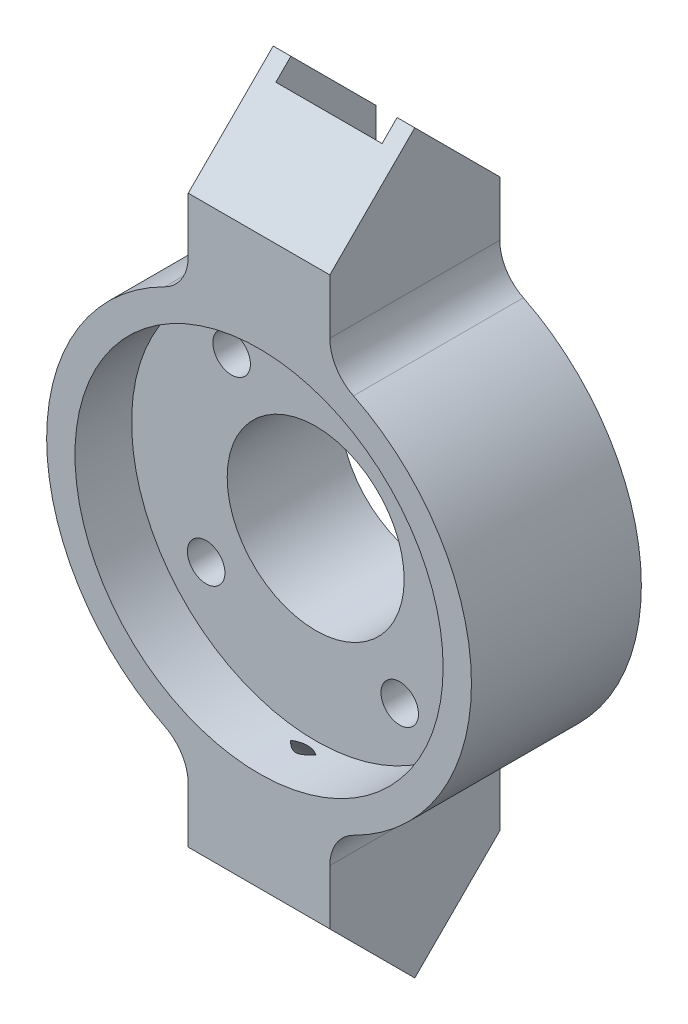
ISO-10303-21;
HEADER;
FILE_DESCRIPTION(('STEP AP214'),'2;1');
FILE_NAME('part.step','',(''),(''),'','','');
FILE_SCHEMA(('AUTOMOTIVE_DESIGN { 1 0 10303 214 1 1 1 1 }'));
ENDSEC;
DATA;
#1=APPLICATION_CONTEXT('core data for automotive mechanical design processes');
#2=APPLICATION_PROTOCOL_DEFINITION('international standard','automotive_design',2000,#1);
#3=PRODUCT_CONTEXT('',#1,'mechanical');
#4=PRODUCT('Part','Part','',(#3));
#5=PRODUCT_RELATED_PRODUCT_CATEGORY('part','',(#4));
#6=PRODUCT_DEFINITION_FORMATION('','',#4);
#7=PRODUCT_DEFINITION_CONTEXT('part definition',#1,'design');
#8=PRODUCT_DEFINITION('design','',#6,#7);
#9=PRODUCT_DEFINITION_SHAPE('','',#8);
#10=(LENGTH_UNIT() NAMED_UNIT(*) SI_UNIT(.MILLI.,.METRE.));
#11=(NAMED_UNIT(*) PLANE_ANGLE_UNIT() SI_UNIT($,.RADIAN.));
#12=(NAMED_UNIT(*) SI_UNIT($,.STERADIAN.) SOLID_ANGLE_UNIT());
#13=UNCERTAINTY_MEASURE_WITH_UNIT(LENGTH_MEASURE(1.E-05),#10,'distance_accuracy_value','');
#14=(GEOMETRIC_REPRESENTATION_CONTEXT(3) GLOBAL_UNCERTAINTY_ASSIGNED_CONTEXT((#13)) GLOBAL_UNIT_ASSIGNED_CONTEXT((#10,
#11,#12)) REPRESENTATION_CONTEXT('',''));
#15=CARTESIAN_POINT('',(0.,0.,0.));
#16=DIRECTION('',(0.,0.,1.));
#17=DIRECTION('',(1.,0.,0.));
#18=AXIS2_PLACEMENT_3D('',#15,#16,#17);
#19=CARTESIAN_POINT('',(0.,-40.,1.5));
#20=DIRECTION('',(0.,0.707106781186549,0.707106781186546));
#21=DIRECTION('',(0.,-0.707106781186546,0.707106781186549));
#22=AXIS2_PLACEMENT_3D('',#19,#20,#21);
#23=PLANE('',#22);
#24=DIRECTION('',(0.,-0.707106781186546,0.707106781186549));
#25=VECTOR('',#24,1.);
#26=CARTESIAN_POINT('',(-7.5,-40.,1.5));
#27=LINE('',#26,#25);
#28=CARTESIAN_POINT('',(-7.5,-51.9999999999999,13.4999999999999));
#29=VERTEX_POINT('',#28);
#30=CARTESIAN_POINT('',(-7.5,-40.,1.50000000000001));
#31=VERTEX_POINT('',#30);
#32=EDGE_CURVE('E551',#29,#31,#27,.F.);
#33=ORIENTED_EDGE('',*,*,#32,.F.);
#34=DIRECTION('',(-1.,0.,0.));
#35=VECTOR('',#34,1.);
#36=CARTESIAN_POINT('',(0.,-51.9999999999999,13.4999999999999));
#37=LINE('',#36,#35);
#38=CARTESIAN_POINT('',(-10.,-51.9999999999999,13.4999999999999));
#39=VERTEX_POINT('',#38);
#40=EDGE_CURVE('E291',#29,#39,#37,.T.);
#41=ORIENTED_EDGE('',*,*,#40,.T.);
#42=DIRECTION('',(0.,0.707106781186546,-0.707106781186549));
#43=VECTOR('',#42,1.);
#44=CARTESIAN_POINT('',(-10.,-59.5,21.));
#45=LINE('',#44,#43);
#46=CARTESIAN_POINT('',(-10.,-40.,1.5));
#47=VERTEX_POINT('',#46);
#48=EDGE_CURVE('E270',#47,#39,#45,.F.);
#49=ORIENTED_EDGE('',*,*,#48,.F.);
#50=DIRECTION('',(-1.,0.,0.));
#51=VECTOR('',#50,1.);
#52=CARTESIAN_POINT('',(0.,-40.,1.5));
#53=LINE('',#52,#51);
#54=EDGE_CURVE('E541',#31,#47,#53,.T.);
#55=ORIENTED_EDGE('',*,*,#54,.F.);
#56=EDGE_LOOP('',(#33,#41,#49,#55));
#57=FACE_BOUND('',#56,.T.);
#58=ADVANCED_FACE('F49',(#57),#23,.F.);
#59=CARTESIAN_POINT('',(0.,40.,1.5));
#60=DIRECTION('',(0.,-0.707106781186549,0.707106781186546));
#61=DIRECTION('',(0.,-0.707106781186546,-0.707106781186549));
#62=AXIS2_PLACEMENT_3D('',#59,#60,#61);
#63=PLANE('',#62);
#64=DIRECTION('',(0.,0.707106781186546,0.707106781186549));
#65=VECTOR('',#64,1.);
#66=CARTESIAN_POINT('',(7.5,40.,1.5));
#67=LINE('',#66,#65);
#68=CARTESIAN_POINT('',(7.5,51.9999999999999,13.4999999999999));
#69=VERTEX_POINT('',#68);
#70=CARTESIAN_POINT('',(7.5,40.,1.50000000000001));
#71=VERTEX_POINT('',#70);
#72=EDGE_CURVE('E547',#69,#71,#67,.F.);
#73=ORIENTED_EDGE('',*,*,#72,.F.);
#74=DIRECTION('',(1.,0.,0.));
#75=VECTOR('',#74,1.);
#76=CARTESIAN_POINT('',(0.,51.9999999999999,13.4999999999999));
#77=LINE('',#76,#75);
#78=CARTESIAN_POINT('',(10.,51.9999999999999,13.4999999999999));
#79=VERTEX_POINT('',#78);
#80=EDGE_CURVE('E561',#69,#79,#77,.T.);
#81=ORIENTED_EDGE('',*,*,#80,.T.);
#82=DIRECTION('',(0.,-0.707106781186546,-0.707106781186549));
#83=VECTOR('',#82,1.);
#84=CARTESIAN_POINT('',(10.,46.142135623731,7.642135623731));
#85=LINE('',#84,#83);
#86=CARTESIAN_POINT('',(10.,40.,1.5));
#87=VERTEX_POINT('',#86);
#88=EDGE_CURVE('E536',#87,#79,#85,.F.);
#89=ORIENTED_EDGE('',*,*,#88,.F.);
#90=DIRECTION('',(1.,0.,0.));
#91=VECTOR('',#90,1.);
#92=CARTESIAN_POINT('',(0.,40.,1.5));
#93=LINE('',#92,#91);
#94=EDGE_CURVE('E532',#71,#87,#93,.T.);
#95=ORIENTED_EDGE('',*,*,#94,.F.);
#96=EDGE_LOOP('',(#73,#81,#89,#95));
#97=FACE_BOUND('',#96,.T.);
#98=ADVANCED_FACE('F232',(#97),#63,.F.);
#99=CARTESIAN_POINT('',(0.,0.,25.5));
#100=DIRECTION('',(0.,0.,1.));
#101=DIRECTION('',(1.,0.,0.));
#102=AXIS2_PLACEMENT_3D('',#99,#100,#101);
#103=PLANE('',#102);
#104=CARTESIAN_POINT('',(0.,0.,25.5));
#105=DIRECTION('',(0.,0.,1.));
#106=DIRECTION('',(1.,0.,0.));
#107=AXIS2_PLACEMENT_3D('',#104,#105,#106);
#108=CIRCLE('',#107,26.);
#109=CARTESIAN_POINT('',(26.,0.,25.5));
#110=VERTEX_POINT('',#109);
#111=EDGE_CURVE('E462',#110,#110,#108,.T.);
#112=ORIENTED_EDGE('',*,*,#111,.F.);
#113=EDGE_LOOP('',(#112));
#114=FACE_BOUND('',#113,.T.);
#115=DIRECTION('',(0.,1.,0.));
#116=VECTOR('',#115,1.);
#117=CARTESIAN_POINT('',(-10.,-55.,25.5));
#118=LINE('',#117,#116);
#119=CARTESIAN_POINT('',(-10.,-39.9999999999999,25.5));
#120=VERTEX_POINT('',#119);
#121=CARTESIAN_POINT('',(-10.,-32.2490309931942,25.5));
#122=VERTEX_POINT('',#121);
#123=EDGE_CURVE('E582',#120,#122,#118,.T.);
#124=ORIENTED_EDGE('',*,*,#123,.F.);
#125=DIRECTION('',(1.,0.,0.));
#126=VECTOR('',#125,1.);
#127=CARTESIAN_POINT('',(0.,-39.9999999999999,25.5));
#128=LINE('',#127,#126);
#129=CARTESIAN_POINT('',(10.,-39.9999999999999,25.5));
#130=VERTEX_POINT('',#129);
#131=EDGE_CURVE('E295',#120,#130,#128,.T.);
#132=ORIENTED_EDGE('',*,*,#131,.T.);
#133=DIRECTION('',(0.,-1.,0.));
#134=VECTOR('',#133,1.);
#135=CARTESIAN_POINT('',(10.,-28.2842712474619,25.5));
#136=LINE('',#135,#134);
#137=CARTESIAN_POINT('',(10.,-32.2490309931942,25.5));
#138=VERTEX_POINT('',#137);
#139=EDGE_CURVE('E655',#138,#130,#136,.T.);
#140=ORIENTED_EDGE('',*,*,#139,.F.);
#141=CARTESIAN_POINT('',(16.,-32.2490309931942,25.5));
#142=DIRECTION('',(0.,0.,1.));
#143=DIRECTION('',(1.,0.,0.));
#144=AXIS2_PLACEMENT_3D('',#141,#142,#143);
#145=CIRCLE('',#144,6.);
#146=CARTESIAN_POINT('',(13.3333333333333,-26.8741924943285,25.5));
#147=VERTEX_POINT('',#146);
#148=EDGE_CURVE('E516',#138,#147,#145,.F.);
#149=ORIENTED_EDGE('',*,*,#148,.T.);
#150=CARTESIAN_POINT('',(0.,0.,25.5));
#151=DIRECTION('',(0.,0.,-1.));
#152=DIRECTION('',(-1.,0.,0.));
#153=AXIS2_PLACEMENT_3D('',#150,#151,#152);
#154=CIRCLE('',#153,30.);
#155=CARTESIAN_POINT('',(13.3333333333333,26.8741924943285,25.5));
#156=VERTEX_POINT('',#155);
#157=EDGE_CURVE('E602',#156,#147,#154,.T.);
#158=ORIENTED_EDGE('',*,*,#157,.F.);
#159=CARTESIAN_POINT('',(16.,32.2490309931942,25.5));
#160=DIRECTION('',(0.,0.,1.));
#161=DIRECTION('',(1.,0.,0.));
#162=AXIS2_PLACEMENT_3D('',#159,#160,#161);
#163=CIRCLE('',#162,6.);
#164=CARTESIAN_POINT('',(10.,32.2490309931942,25.5));
#165=VERTEX_POINT('',#164);
#166=EDGE_CURVE('E529',#156,#165,#163,.F.);
#167=ORIENTED_EDGE('',*,*,#166,.T.);
#168=DIRECTION('',(0.,-1.,0.));
#169=VECTOR('',#168,1.);
#170=CARTESIAN_POINT('',(10.,28.2842712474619,25.5));
#171=LINE('',#170,#169);
#172=CARTESIAN_POINT('',(10.,39.9999999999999,25.5));
#173=VERTEX_POINT('',#172);
#174=EDGE_CURVE('E495',#173,#165,#171,.T.);
#175=ORIENTED_EDGE('',*,*,#174,.F.);
#176=DIRECTION('',(-1.,0.,0.));
#177=VECTOR('',#176,1.);
#178=CARTESIAN_POINT('',(0.,39.9999999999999,25.5));
#179=LINE('',#178,#177);
#180=CARTESIAN_POINT('',(-10.,39.9999999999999,25.5));
#181=VERTEX_POINT('',#180);
#182=EDGE_CURVE('E284',#173,#181,#179,.T.);
#183=ORIENTED_EDGE('',*,*,#182,.T.);
#184=DIRECTION('',(0.,1.,0.));
#185=VECTOR('',#184,1.);
#186=CARTESIAN_POINT('',(-10.,55.,25.5));
#187=LINE('',#186,#185);
#188=CARTESIAN_POINT('',(-10.,32.2490309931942,25.5));
#189=VERTEX_POINT('',#188);
#190=EDGE_CURVE('E571',#189,#181,#187,.T.);
#191=ORIENTED_EDGE('',*,*,#190,.F.);
#192=CARTESIAN_POINT('',(-16.,32.2490309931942,25.5));
#193=DIRECTION('',(0.,0.,1.));
#194=DIRECTION('',(1.,0.,0.));
#195=AXIS2_PLACEMENT_3D('',#192,#193,#194);
#196=CIRCLE('',#195,6.);
#197=CARTESIAN_POINT('',(-13.3333333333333,26.8741924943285,25.5));
#198=VERTEX_POINT('',#197);
#199=EDGE_CURVE('E525',#189,#198,#196,.F.);
#200=ORIENTED_EDGE('',*,*,#199,.T.);
#201=CARTESIAN_POINT('',(0.,0.,25.5));
#202=DIRECTION('',(0.,0.,-1.));
#203=DIRECTION('',(-1.,0.,0.));
#204=AXIS2_PLACEMENT_3D('',#201,#202,#203);
#205=CIRCLE('',#204,30.);
#206=CARTESIAN_POINT('',(-13.3333333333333,-26.8741924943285,25.5));
#207=VERTEX_POINT('',#206);
#208=EDGE_CURVE('E578',#207,#198,#205,.T.);
#209=ORIENTED_EDGE('',*,*,#208,.F.);
#210=CARTESIAN_POINT('',(-16.,-32.2490309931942,25.5));
#211=DIRECTION('',(0.,0.,1.));
#212=DIRECTION('',(1.,0.,0.));
#213=AXIS2_PLACEMENT_3D('',#210,#211,#212);
#214=CIRCLE('',#213,6.);
#215=EDGE_CURVE('E520',#207,#122,#214,.F.);
#216=ORIENTED_EDGE('',*,*,#215,.T.);
#217=EDGE_LOOP('',(#124,#132,#140,#149,#158,#167,#175,#183,#191,#200,#209,#216));
#218=FACE_BOUND('',#217,.T.);
#219=ADVANCED_FACE('F239',(#114,#218),#103,.T.);
#220=CARTESIAN_POINT('',(0.,0.,1.5));
#221=DIRECTION('',(0.,0.,-1.));
#222=DIRECTION('',(-1.,0.,0.));
#223=AXIS2_PLACEMENT_3D('',#220,#221,#222);
#224=PLANE('',#223);
#225=DIRECTION('',(0.,1.,0.));
#226=VECTOR('',#225,1.);
#227=CARTESIAN_POINT('',(-7.5,0.,1.5));
#228=LINE('',#227,#226);
#229=CARTESIAN_POINT('',(-7.5,-35.7573593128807,1.50000000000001));
#230=VERTEX_POINT('',#229);
#231=EDGE_CURVE('E719',#31,#230,#228,.T.);
#232=ORIENTED_EDGE('',*,*,#231,.F.);
#233=ORIENTED_EDGE('',*,*,#54,.T.);
#234=DIRECTION('',(0.,1.,0.));
#235=VECTOR('',#234,1.);
#236=CARTESIAN_POINT('',(-10.,-55.,1.5));
#237=LINE('',#236,#235);
#238=CARTESIAN_POINT('',(-10.,-32.2490309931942,1.5));
#239=VERTEX_POINT('',#238);
#240=EDGE_CURVE('E592',#47,#239,#237,.T.);
#241=ORIENTED_EDGE('',*,*,#240,.T.);
#242=CARTESIAN_POINT('',(-16.,-32.2490309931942,1.5));
#243=DIRECTION('',(0.,0.,-1.));
#244=DIRECTION('',(-1.,0.,0.));
#245=AXIS2_PLACEMENT_3D('',#242,#243,#244);
#246=CIRCLE('',#245,6.);
#247=CARTESIAN_POINT('',(-13.3333333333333,-26.8741924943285,1.5));
#248=VERTEX_POINT('',#247);
#249=EDGE_CURVE('E518',#239,#248,#246,.F.);
#250=ORIENTED_EDGE('',*,*,#249,.T.);
#251=CARTESIAN_POINT('',(0.,0.,1.5));
#252=DIRECTION('',(0.,0.,-1.));
#253=DIRECTION('',(-1.,0.,0.));
#254=AXIS2_PLACEMENT_3D('',#251,#252,#253);
#255=CIRCLE('',#254,30.);
#256=CARTESIAN_POINT('',(-13.3333333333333,26.8741924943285,1.5));
#257=VERTEX_POINT('',#256);
#258=EDGE_CURVE('E594',#248,#257,#255,.T.);
#259=ORIENTED_EDGE('',*,*,#258,.T.);
#260=CARTESIAN_POINT('',(-16.,32.2490309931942,1.5));
#261=DIRECTION('',(0.,0.,-1.));
#262=DIRECTION('',(-1.,0.,0.));
#263=AXIS2_PLACEMENT_3D('',#260,#261,#262);
#264=CIRCLE('',#263,6.);
#265=CARTESIAN_POINT('',(-10.,32.2490309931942,1.5));
#266=VERTEX_POINT('',#265);
#267=EDGE_CURVE('E523',#257,#266,#264,.F.);
#268=ORIENTED_EDGE('',*,*,#267,.T.);
#269=DIRECTION('',(0.,1.,0.));
#270=VECTOR('',#269,1.);
#271=CARTESIAN_POINT('',(-10.,55.,1.5));
#272=LINE('',#271,#270);
#273=CARTESIAN_POINT('',(-10.,40.,1.5));
#274=VERTEX_POINT('',#273);
#275=EDGE_CURVE('E597',#266,#274,#272,.T.);
#276=ORIENTED_EDGE('',*,*,#275,.T.);
#277=CARTESIAN_POINT('',(-7.5,40.,1.5));
#278=VERTEX_POINT('',#277);
#279=EDGE_CURVE('E533',#274,#278,#93,.T.);
#280=ORIENTED_EDGE('',*,*,#279,.T.);
#281=DIRECTION('',(0.,1.,0.));
#282=VECTOR('',#281,1.);
#283=CARTESIAN_POINT('',(-7.5,0.,1.5));
#284=LINE('',#283,#282);
#285=CARTESIAN_POINT('',(-7.5,35.7573593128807,1.50000000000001));
#286=VERTEX_POINT('',#285);
#287=EDGE_CURVE('E690',#286,#278,#284,.T.);
#288=ORIENTED_EDGE('',*,*,#287,.F.);
#289=DIRECTION('',(1.,0.,0.));
#290=VECTOR('',#289,1.);
#291=CARTESIAN_POINT('',(0.,35.7573593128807,1.5));
#292=LINE('',#291,#290);
#293=CARTESIAN_POINT('',(7.5,35.7573593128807,1.50000000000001));
#294=VERTEX_POINT('',#293);
#295=EDGE_CURVE('E590',#286,#294,#292,.T.);
#296=ORIENTED_EDGE('',*,*,#295,.T.);
#297=DIRECTION('',(0.,-1.,0.));
#298=VECTOR('',#297,1.);
#299=CARTESIAN_POINT('',(7.5,0.,1.5));
#300=LINE('',#299,#298);
#301=EDGE_CURVE('E693',#71,#294,#300,.T.);
#302=ORIENTED_EDGE('',*,*,#301,.F.);
#303=ORIENTED_EDGE('',*,*,#94,.T.);
#304=DIRECTION('',(0.,-1.,0.));
#305=VECTOR('',#304,1.);
#306=CARTESIAN_POINT('',(10.,28.2842712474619,1.5));
#307=LINE('',#306,#305);
#308=CARTESIAN_POINT('',(10.,32.2490309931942,1.5));
#309=VERTEX_POINT('',#308);
#310=EDGE_CURVE('E600',#87,#309,#307,.T.);
#311=ORIENTED_EDGE('',*,*,#310,.T.);
#312=CARTESIAN_POINT('',(16.,32.2490309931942,1.5));
#313=DIRECTION('',(0.,0.,-1.));
#314=DIRECTION('',(-1.,0.,0.));
#315=AXIS2_PLACEMENT_3D('',#312,#313,#314);
#316=CIRCLE('',#315,6.);
#317=CARTESIAN_POINT('',(13.3333333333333,26.8741924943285,1.5));
#318=VERTEX_POINT('',#317);
#319=EDGE_CURVE('E527',#309,#318,#316,.F.);
#320=ORIENTED_EDGE('',*,*,#319,.T.);
#321=CARTESIAN_POINT('',(0.,0.,1.5));
#322=DIRECTION('',(0.,0.,-1.));
#323=DIRECTION('',(-1.,0.,0.));
#324=AXIS2_PLACEMENT_3D('',#321,#322,#323);
#325=CIRCLE('',#324,30.);
#326=CARTESIAN_POINT('',(13.3333333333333,-26.8741924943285,1.5));
#327=VERTEX_POINT('',#326);
#328=EDGE_CURVE('E586',#318,#327,#325,.T.);
#329=ORIENTED_EDGE('',*,*,#328,.T.);
#330=CARTESIAN_POINT('',(16.,-32.2490309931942,1.5));
#331=DIRECTION('',(0.,0.,-1.));
#332=DIRECTION('',(-1.,0.,0.));
#333=AXIS2_PLACEMENT_3D('',#330,#331,#332);
#334=CIRCLE('',#333,6.);
#335=CARTESIAN_POINT('',(10.,-32.2490309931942,1.5));
#336=VERTEX_POINT('',#335);
#337=EDGE_CURVE('E514',#327,#336,#334,.F.);
#338=ORIENTED_EDGE('',*,*,#337,.T.);
#339=DIRECTION('',(0.,-1.,0.));
#340=VECTOR('',#339,1.);
#341=CARTESIAN_POINT('',(10.,-28.2842712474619,1.5));
#342=LINE('',#341,#340);
#343=CARTESIAN_POINT('',(10.,-40.,1.5));
#344=VERTEX_POINT('',#343);
#345=EDGE_CURVE('E589',#336,#344,#342,.T.);
#346=ORIENTED_EDGE('',*,*,#345,.T.);
#347=CARTESIAN_POINT('',(7.5,-40.,1.5));
#348=VERTEX_POINT('',#347);
#349=EDGE_CURVE('E265',#344,#348,#53,.T.);
#350=ORIENTED_EDGE('',*,*,#349,.T.);
#351=DIRECTION('',(0.,-1.,0.));
#352=VECTOR('',#351,1.);
#353=CARTESIAN_POINT('',(7.5,0.,1.5));
#354=LINE('',#353,#352);
#355=CARTESIAN_POINT('',(7.5,-35.7573593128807,1.50000000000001));
#356=VERTEX_POINT('',#355);
#357=EDGE_CURVE('E722',#356,#348,#354,.T.);
#358=ORIENTED_EDGE('',*,*,#357,.F.);
#359=DIRECTION('',(-1.,0.,0.));
#360=VECTOR('',#359,1.);
#361=CARTESIAN_POINT('',(0.,-35.7573593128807,1.5));
#362=LINE('',#361,#360);
#363=EDGE_CURVE('E695',#356,#230,#362,.T.);
#364=ORIENTED_EDGE('',*,*,#363,.T.);
#365=EDGE_LOOP('',(#232,#233,#241,#250,#259,#268,#276,#280,#288,#296,#302,#303,#311,#320,#329,
#338,#346,#350,#358,#364));
#366=FACE_BOUND('',#365,.T.);
#367=CARTESIAN_POINT('',(0.,0.,1.5));
#368=DIRECTION('',(0.,0.,-1.));
#369=DIRECTION('',(-1.,0.,0.));
#370=AXIS2_PLACEMENT_3D('',#367,#368,#369);
#371=CIRCLE('',#370,12.5);
#372=CARTESIAN_POINT('',(-12.5,0.,1.5));
#373=VERTEX_POINT('',#372);
#374=EDGE_CURVE('E611',#373,#373,#371,.F.);
#375=ORIENTED_EDGE('',*,*,#374,.T.);
#376=EDGE_LOOP('',(#375));
#377=FACE_BOUND('',#376,.T.);
#378=CARTESIAN_POINT('',(-11.87084786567,15.4703901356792,1.5));
#379=DIRECTION('',(0.,0.,-1.));
#380=DIRECTION('',(-1.,0.,0.));
#381=AXIS2_PLACEMENT_3D('',#378,#379,#380);
#382=CIRCLE('',#381,5.);
#383=CARTESIAN_POINT('',(-16.87084786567,15.4703901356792,1.5));
#384=VERTEX_POINT('',#383);
#385=EDGE_CURVE('E605',#384,#384,#382,.F.);
#386=ORIENTED_EDGE('',*,*,#385,.T.);
#387=EDGE_LOOP('',(#386));
#388=FACE_BOUND('',#387,.T.);
#389=CARTESIAN_POINT('',(-15.4703901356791,-11.87084786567,1.5));
#390=DIRECTION('',(0.,0.,-1.));
#391=DIRECTION('',(-1.,0.,0.));
#392=AXIS2_PLACEMENT_3D('',#389,#390,#391);
#393=CIRCLE('',#392,5.);
#394=CARTESIAN_POINT('',(-20.4703901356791,-11.87084786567,1.5));
#395=VERTEX_POINT('',#394);
#396=EDGE_CURVE('E492',#395,#395,#393,.F.);
#397=ORIENTED_EDGE('',*,*,#396,.T.);
#398=EDGE_LOOP('',(#397));
#399=FACE_BOUND('',#398,.T.);
#400=CARTESIAN_POINT('',(11.8708478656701,-15.4703901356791,1.5));
#401=DIRECTION('',(0.,0.,-1.));
#402=DIRECTION('',(-1.,0.,0.));
#403=AXIS2_PLACEMENT_3D('',#400,#401,#402);
#404=CIRCLE('',#403,5.);
#405=CARTESIAN_POINT('',(6.87084786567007,-15.4703901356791,1.5));
#406=VERTEX_POINT('',#405);
#407=EDGE_CURVE('E494',#406,#406,#404,.F.);
#408=ORIENTED_EDGE('',*,*,#407,.T.);
#409=EDGE_LOOP('',(#408));
#410=FACE_BOUND('',#409,.T.);
#411=CARTESIAN_POINT('',(15.470390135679,11.8708478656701,1.5));
#412=DIRECTION('',(0.,0.,-1.));
#413=DIRECTION('',(-1.,0.,0.));
#414=AXIS2_PLACEMENT_3D('',#411,#412,#413);
#415=CIRCLE('',#414,5.);
#416=CARTESIAN_POINT('',(10.470390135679,11.8708478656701,1.5));
#417=VERTEX_POINT('',#416);
#418=EDGE_CURVE('E608',#417,#417,#415,.F.);
#419=ORIENTED_EDGE('',*,*,#418,.T.);
#420=EDGE_LOOP('',(#419));
#421=FACE_BOUND('',#420,.T.);
#422=ADVANCED_FACE('F366',(#366,#377,#388,#399,#410,#421),#224,.T.);
#423=CARTESIAN_POINT('',(0.,0.,25.5));
#424=DIRECTION('',(0.,0.,-1.));
#425=DIRECTION('',(-1.,0.,0.));
#426=AXIS2_PLACEMENT_3D('',#423,#424,#425);
#427=CYLINDRICAL_SURFACE('',#426,12.5);
#428=CARTESIAN_POINT('',(0.,0.,17.5));
#429=DIRECTION('',(0.,0.,1.));
#430=DIRECTION('',(1.,0.,0.));
#431=AXIS2_PLACEMENT_3D('',#428,#429,#430);
#432=CIRCLE('',#431,12.5);
#433=CARTESIAN_POINT('',(12.5,0.,17.5));
#434=VERTEX_POINT('',#433);
#435=EDGE_CURVE('E456',#434,#434,#432,.T.);
#436=ORIENTED_EDGE('',*,*,#435,.T.);
#437=EDGE_LOOP('',(#436));
#438=FACE_BOUND('',#437,.T.);
#439=ORIENTED_EDGE('',*,*,#374,.F.);
#440=EDGE_LOOP('',(#439));
#441=FACE_BOUND('',#440,.T.);
#442=ADVANCED_FACE('F369',(#438,#441),#427,.F.);
#443=CARTESIAN_POINT('',(15.470390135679,11.8708478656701,5.));
#444=DIRECTION('',(0.,0.,-1.));
#445=DIRECTION('',(-1.,0.,0.));
#446=AXIS2_PLACEMENT_3D('',#443,#444,#445);
#447=CYLINDRICAL_SURFACE('',#446,5.);
#448=CARTESIAN_POINT('',(15.470390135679,11.8708478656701,5.));
#449=DIRECTION('',(0.,0.,-1.));
#450=DIRECTION('',(-1.,0.,0.));
#451=AXIS2_PLACEMENT_3D('',#448,#449,#450);
#452=CIRCLE('',#451,5.);
#453=CARTESIAN_POINT('',(10.470390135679,11.8708478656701,5.));
#454=VERTEX_POINT('',#453);
#455=EDGE_CURVE('E479',#454,#454,#452,.T.);
#456=ORIENTED_EDGE('',*,*,#455,.F.);
#457=EDGE_LOOP('',(#456));
#458=FACE_BOUND('',#457,.T.);
#459=ORIENTED_EDGE('',*,*,#418,.F.);
#460=EDGE_LOOP('',(#459));
#461=FACE_BOUND('',#460,.T.);
#462=ADVANCED_FACE('F395',(#458,#461),#447,.F.);
#463=CARTESIAN_POINT('',(-11.87084786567,15.4703901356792,5.));
#464=DIRECTION('',(0.,0.,-1.));
#465=DIRECTION('',(-1.,0.,0.));
#466=AXIS2_PLACEMENT_3D('',#463,#464,#465);
#467=CYLINDRICAL_SURFACE('',#466,5.);
#468=CARTESIAN_POINT('',(-11.87084786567,15.4703901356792,5.));
#469=DIRECTION('',(0.,0.,-1.));
#470=DIRECTION('',(-1.,0.,0.));
#471=AXIS2_PLACEMENT_3D('',#468,#469,#470);
#472=CIRCLE('',#471,5.);
#473=CARTESIAN_POINT('',(-16.87084786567,15.4703901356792,5.));
#474=VERTEX_POINT('',#473);
#475=EDGE_CURVE('E483',#474,#474,#472,.T.);
#476=ORIENTED_EDGE('',*,*,#475,.F.);
#477=EDGE_LOOP('',(#476));
#478=FACE_BOUND('',#477,.T.);
#479=ORIENTED_EDGE('',*,*,#385,.F.);
#480=EDGE_LOOP('',(#479));
#481=FACE_BOUND('',#480,.T.);
#482=ADVANCED_FACE('F387',(#478,#481),#467,.F.);
#483=CARTESIAN_POINT('',(11.8708478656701,-15.4703901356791,5.));
#484=DIRECTION('',(0.,0.,-1.));
#485=DIRECTION('',(-1.,0.,0.));
#486=AXIS2_PLACEMENT_3D('',#483,#484,#485);
#487=CYLINDRICAL_SURFACE('',#486,5.);
#488=CARTESIAN_POINT('',(11.8708478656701,-15.4703901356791,5.));
#489=DIRECTION('',(0.,0.,-1.));
#490=DIRECTION('',(-1.,0.,0.));
#491=AXIS2_PLACEMENT_3D('',#488,#489,#490);
#492=CIRCLE('',#491,5.);
#493=CARTESIAN_POINT('',(6.87084786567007,-15.4703901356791,5.));
#494=VERTEX_POINT('',#493);
#495=EDGE_CURVE('E487',#494,#494,#492,.T.);
#496=ORIENTED_EDGE('',*,*,#495,.F.);
#497=EDGE_LOOP('',(#496));
#498=FACE_BOUND('',#497,.T.);
#499=ORIENTED_EDGE('',*,*,#407,.F.);
#500=EDGE_LOOP('',(#499));
#501=FACE_BOUND('',#500,.T.);
#502=ADVANCED_FACE('F379',(#498,#501),#487,.F.);
#503=CARTESIAN_POINT('',(-15.4703901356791,-11.87084786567,5.));
#504=DIRECTION('',(0.,0.,-1.));
#505=DIRECTION('',(-1.,0.,0.));
#506=AXIS2_PLACEMENT_3D('',#503,#504,#505);
#507=CYLINDRICAL_SURFACE('',#506,5.);
#508=CARTESIAN_POINT('',(-15.4703901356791,-11.87084786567,5.));
#509=DIRECTION('',(0.,0.,-1.));
#510=DIRECTION('',(-1.,0.,0.));
#511=AXIS2_PLACEMENT_3D('',#508,#509,#510);
#512=CIRCLE('',#511,5.);
#513=CARTESIAN_POINT('',(-20.4703901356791,-11.87084786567,5.));
#514=VERTEX_POINT('',#513);
#515=EDGE_CURVE('E491',#514,#514,#512,.T.);
#516=ORIENTED_EDGE('',*,*,#515,.F.);
#517=EDGE_LOOP('',(#516));
#518=FACE_BOUND('',#517,.T.);
#519=ORIENTED_EDGE('',*,*,#396,.F.);
#520=EDGE_LOOP('',(#519));
#521=FACE_BOUND('',#520,.T.);
#522=ADVANCED_FACE('F375',(#518,#521),#507,.F.);
#523=CARTESIAN_POINT('',(-15.4703901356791,-11.87084786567,0.));
#524=DIRECTION('',(0.,0.,-1.));
#525=DIRECTION('',(-1.,0.,0.));
#526=AXIS2_PLACEMENT_3D('',#523,#524,#525);
#527=CYLINDRICAL_SURFACE('',#526,2.64999999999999);
#528=CARTESIAN_POINT('',(-15.4703901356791,-11.87084786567,17.5));
#529=DIRECTION('',(0.,0.,1.));
#530=DIRECTION('',(1.,0.,0.));
#531=AXIS2_PLACEMENT_3D('',#528,#529,#530);
#532=CIRCLE('',#531,2.64999999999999);
#533=CARTESIAN_POINT('',(-12.8203901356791,-11.87084786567,17.5));
#534=VERTEX_POINT('',#533);
#535=EDGE_CURVE('E448',#534,#534,#532,.T.);
#536=ORIENTED_EDGE('',*,*,#535,.T.);
#537=EDGE_LOOP('',(#536));
#538=FACE_BOUND('',#537,.T.);
#539=CARTESIAN_POINT('',(-15.4703901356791,-11.87084786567,5.));
#540=DIRECTION('',(0.,0.,-1.));
#541=DIRECTION('',(-1.,0.,0.));
#542=AXIS2_PLACEMENT_3D('',#539,#540,#541);
#543=CIRCLE('',#542,2.64999999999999);
#544=CARTESIAN_POINT('',(-18.1203901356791,-11.87084786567,5.));
#545=VERTEX_POINT('',#544);
#546=EDGE_CURVE('E488',#545,#545,#543,.F.);
#547=ORIENTED_EDGE('',*,*,#546,.F.);
#548=EDGE_LOOP('',(#547));
#549=FACE_BOUND('',#548,.T.);
#550=ADVANCED_FACE('F378',(#538,#549),#527,.F.);
#551=CARTESIAN_POINT('',(11.8708478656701,-15.4703901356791,0.));
#552=DIRECTION('',(0.,0.,-1.));
#553=DIRECTION('',(-1.,0.,0.));
#554=AXIS2_PLACEMENT_3D('',#551,#552,#553);
#555=CYLINDRICAL_SURFACE('',#554,2.64999999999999);
#556=CARTESIAN_POINT('',(11.8708478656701,-15.4703901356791,17.5));
#557=DIRECTION('',(0.,0.,1.));
#558=DIRECTION('',(1.,0.,0.));
#559=AXIS2_PLACEMENT_3D('',#556,#557,#558);
#560=CIRCLE('',#559,2.64999999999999);
#561=CARTESIAN_POINT('',(14.5208478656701,-15.4703901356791,17.5));
#562=VERTEX_POINT('',#561);
#563=EDGE_CURVE('E444',#562,#562,#560,.T.);
#564=ORIENTED_EDGE('',*,*,#563,.T.);
#565=EDGE_LOOP('',(#564));
#566=FACE_BOUND('',#565,.T.);
#567=CARTESIAN_POINT('',(11.8708478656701,-15.4703901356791,5.));
#568=DIRECTION('',(0.,0.,-1.));
#569=DIRECTION('',(-1.,0.,0.));
#570=AXIS2_PLACEMENT_3D('',#567,#568,#569);
#571=CIRCLE('',#570,2.64999999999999);
#572=CARTESIAN_POINT('',(9.22084786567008,-15.4703901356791,5.));
#573=VERTEX_POINT('',#572);
#574=EDGE_CURVE('E484',#573,#573,#571,.F.);
#575=ORIENTED_EDGE('',*,*,#574,.F.);
#576=EDGE_LOOP('',(#575));
#577=FACE_BOUND('',#576,.T.);
#578=ADVANCED_FACE('F409',(#566,#577),#555,.F.);
#579=CARTESIAN_POINT('',(-11.87084786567,15.4703901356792,0.));
#580=DIRECTION('',(0.,0.,-1.));
#581=DIRECTION('',(-1.,0.,0.));
#582=AXIS2_PLACEMENT_3D('',#579,#580,#581);
#583=CYLINDRICAL_SURFACE('',#582,2.64999999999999);
#584=CARTESIAN_POINT('',(-11.87084786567,15.4703901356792,17.5));
#585=DIRECTION('',(0.,0.,1.));
#586=DIRECTION('',(1.,0.,0.));
#587=AXIS2_PLACEMENT_3D('',#584,#585,#586);
#588=CIRCLE('',#587,2.64999999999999);
#589=CARTESIAN_POINT('',(-9.22084786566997,15.4703901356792,17.5));
#590=VERTEX_POINT('',#589);
#591=EDGE_CURVE('E452',#590,#590,#588,.T.);
#592=ORIENTED_EDGE('',*,*,#591,.T.);
#593=EDGE_LOOP('',(#592));
#594=FACE_BOUND('',#593,.T.);
#595=CARTESIAN_POINT('',(-11.87084786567,15.4703901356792,5.));
#596=DIRECTION('',(0.,0.,-1.));
#597=DIRECTION('',(-1.,0.,0.));
#598=AXIS2_PLACEMENT_3D('',#595,#596,#597);
#599=CIRCLE('',#598,2.64999999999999);
#600=CARTESIAN_POINT('',(-14.5208478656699,15.4703901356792,5.));
#601=VERTEX_POINT('',#600);
#602=EDGE_CURVE('E480',#601,#601,#599,.F.);
#603=ORIENTED_EDGE('',*,*,#602,.F.);
#604=EDGE_LOOP('',(#603));
#605=FACE_BOUND('',#604,.T.);
#606=ADVANCED_FACE('F407',(#594,#605),#583,.F.);
#607=CARTESIAN_POINT('',(15.470390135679,11.8708478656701,0.));
#608=DIRECTION('',(0.,0.,-1.));
#609=DIRECTION('',(-1.,0.,0.));
#610=AXIS2_PLACEMENT_3D('',#607,#608,#609);
#611=CYLINDRICAL_SURFACE('',#610,2.64999999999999);
#612=CARTESIAN_POINT('',(15.470390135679,11.8708478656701,17.5));
#613=DIRECTION('',(0.,0.,1.));
#614=DIRECTION('',(1.,0.,0.));
#615=AXIS2_PLACEMENT_3D('',#612,#613,#614);
#616=CIRCLE('',#615,2.64999999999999);
#617=CARTESIAN_POINT('',(18.120390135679,11.8708478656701,17.5));
#618=VERTEX_POINT('',#617);
#619=EDGE_CURVE('E440',#618,#618,#616,.T.);
#620=ORIENTED_EDGE('',*,*,#619,.T.);
#621=EDGE_LOOP('',(#620));
#622=FACE_BOUND('',#621,.T.);
#623=CARTESIAN_POINT('',(15.470390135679,11.8708478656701,5.));
#624=DIRECTION('',(0.,0.,-1.));
#625=DIRECTION('',(-1.,0.,0.));
#626=AXIS2_PLACEMENT_3D('',#623,#624,#625);
#627=CIRCLE('',#626,2.64999999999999);
#628=CARTESIAN_POINT('',(12.820390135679,11.8708478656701,5.));
#629=VERTEX_POINT('',#628);
#630=EDGE_CURVE('E476',#629,#629,#627,.F.);
#631=ORIENTED_EDGE('',*,*,#630,.F.);
#632=EDGE_LOOP('',(#631));
#633=FACE_BOUND('',#632,.T.);
#634=ADVANCED_FACE('F404',(#622,#633),#611,.F.);
#635=CARTESIAN_POINT('',(0.,0.,17.5));
#636=DIRECTION('',(0.,0.,1.));
#637=DIRECTION('',(1.,0.,0.));
#638=AXIS2_PLACEMENT_3D('',#635,#636,#637);
#639=CYLINDRICAL_SURFACE('',#638,26.);
#640=CARTESIAN_POINT('',(-2.05032824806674,25.9190307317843,18.9798775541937));
#641=CARTESIAN_POINT('',(-1.99326174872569,25.9235437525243,19.0419163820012));
#642=CARTESIAN_POINT('',(-1.93563064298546,25.9279142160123,19.1034577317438));
#643=CARTESIAN_POINT('',(-1.81895883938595,25.9363611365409,19.2252951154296));
#644=CARTESIAN_POINT('',(-1.75991713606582,25.9404373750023,19.2855902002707));
#645=CARTESIAN_POINT('',(-1.63813998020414,25.9484170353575,19.406667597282));
#646=CARTESIAN_POINT('',(-1.57534751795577,25.9523094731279,19.4673935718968));
#647=CARTESIAN_POINT('',(-1.44768952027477,25.9597435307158,19.5866165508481));
#648=CARTESIAN_POINT('',(-1.38282469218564,25.9632852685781,19.6451143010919));
#649=CARTESIAN_POINT('',(-1.25029633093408,25.9700053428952,19.7593273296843));
#650=CARTESIAN_POINT('',(-1.18262467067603,25.9731825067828,19.8150333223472));
#651=CARTESIAN_POINT('',(-1.04392392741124,25.9791271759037,19.9223373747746));
#652=CARTESIAN_POINT('',(-0.97289135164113,25.981894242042,19.9739310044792));
#653=CARTESIAN_POINT('',(-0.827661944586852,25.9869234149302,20.0703850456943));
#654=CARTESIAN_POINT('',(-0.753519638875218,25.9891917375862,20.1153257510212));
#655=CARTESIAN_POINT('',(-0.600553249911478,25.9931753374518,20.1962149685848));
#656=CARTESIAN_POINT('',(-0.521742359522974,25.9948920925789,20.232187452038));
#657=CARTESIAN_POINT('',(-0.369435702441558,25.9974718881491,20.2871777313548));
#658=CARTESIAN_POINT('',(-0.296529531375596,25.9984154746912,20.3077650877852));
#659=CARTESIAN_POINT('',(-0.148308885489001,25.9996817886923,20.3355520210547));
#660=CARTESIAN_POINT('',(-0.0730030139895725,26.0000065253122,20.3427949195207));
#661=CARTESIAN_POINT('',(0.0778112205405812,25.9999932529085,20.3425012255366));
#662=CARTESIAN_POINT('',(0.153319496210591,25.9996532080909,20.3349192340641));
#663=CARTESIAN_POINT('',(0.301888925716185,25.9983543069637,20.3064283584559));
#664=CARTESIAN_POINT('',(0.374940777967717,25.9973933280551,20.2854737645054));
#665=CARTESIAN_POINT('',(0.554871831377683,25.9943068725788,20.2197598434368));
#666=CARTESIAN_POINT('',(0.65920160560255,25.9918342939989,20.1682717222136));
#667=CARTESIAN_POINT('',(0.860273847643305,25.9859609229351,20.0513759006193));
#668=CARTESIAN_POINT('',(0.956948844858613,25.9825528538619,19.9858600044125));
#669=CARTESIAN_POINT('',(1.1440161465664,25.97498698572,19.846775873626));
#670=CARTESIAN_POINT('',(1.23441498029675,25.9708299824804,19.7732162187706));
#671=CARTESIAN_POINT('',(1.41074798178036,25.9618486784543,19.6208339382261));
#672=CARTESIAN_POINT('',(1.49667645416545,25.9570235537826,19.5420048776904));
#673=CARTESIAN_POINT('',(1.66200789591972,25.9469524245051,19.3837723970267));
#674=CARTESIAN_POINT('',(1.74153459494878,25.9417282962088,19.3044956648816));
#675=CARTESIAN_POINT('',(1.89779960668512,25.9307619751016,19.1437085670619));
#676=CARTESIAN_POINT('',(1.97454523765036,25.9250213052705,19.062205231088));
#677=CARTESIAN_POINT('',(2.05032824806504,25.9190307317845,18.9798775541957));
#678=B_SPLINE_CURVE_WITH_KNOTS('',3,(#640,#641,#642,#643,#644,#645,#646,#647,#648,#649,#650,
#651,#652,#653,#654,#655,#656,#657,#658,#659,#660,#661,#662,#663,#664,#665,#666,#667,#668,#669,
#670,#671,#672,#673,#674,#675,#676,#677),.UNSPECIFIED.,.F.,.F.,(4,2,2,2,2,2,2,2,2,2,2,2,2,2,2,2,
2,2,4),(0.,0.253251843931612,0.506689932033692,0.768966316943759,1.03115411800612,
1.29416285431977,1.5574511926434,1.81724425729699,2.07633528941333,2.30263700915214,
2.52820275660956,2.75446034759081,2.98149549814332,3.32863846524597,3.67856214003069,
4.02811615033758,4.3781051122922,4.71528060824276,5.05149265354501),.UNSPECIFIED.);
#679=CARTESIAN_POINT('',(-1.78619316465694,25.9385719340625,19.2583770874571));
#680=VERTEX_POINT('',#679);
#681=CARTESIAN_POINT('',(1.78619316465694,25.9385719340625,19.2583770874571));
#682=VERTEX_POINT('',#681);
#683=EDGE_CURVE('E744',#680,#682,#678,.T.);
#684=ORIENTED_EDGE('',*,*,#683,.T.);
#685=CARTESIAN_POINT('',(1.7861931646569,25.9385719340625,19.2583770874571));
#686=CARTESIAN_POINT('',(1.71825352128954,25.9432489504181,19.2092098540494));
#687=CARTESIAN_POINT('',(1.64874592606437,25.9477681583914,19.1622377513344));
#688=CARTESIAN_POINT('',(1.5065466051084,25.9564140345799,19.0731841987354));
#689=CARTESIAN_POINT('',(1.43385162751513,25.9605402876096,19.0311079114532));
#690=CARTESIAN_POINT('',(1.21019896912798,25.9722484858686,18.9126292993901));
#691=CARTESIAN_POINT('',(1.05452806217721,25.9790989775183,18.8446096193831));
#692=CARTESIAN_POINT('',(0.813614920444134,25.9873929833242,18.7629604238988));
#693=CARTESIAN_POINT('',(0.731757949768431,25.9898326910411,18.7390904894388));
#694=CARTESIAN_POINT('',(0.566226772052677,25.9939651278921,18.6987922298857));
#695=CARTESIAN_POINT('',(0.48255353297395,25.9956582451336,18.6823600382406));
#696=CARTESIAN_POINT('',(0.314361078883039,25.998234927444,18.657394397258));
#697=CARTESIAN_POINT('',(0.229846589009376,25.9991217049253,18.6488296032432));
#698=CARTESIAN_POINT('',(0.0604083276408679,26.0000682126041,18.6396909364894));
#699=CARTESIAN_POINT('',(-0.024515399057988,26.0001280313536,18.639116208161));
#700=CARTESIAN_POINT('',(-0.264379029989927,25.9991158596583,18.6488806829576));
#701=CARTESIAN_POINT('',(-0.419025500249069,25.9970649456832,18.6686581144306));
#702=CARTESIAN_POINT('',(-0.723239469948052,25.9903876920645,18.7336260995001));
#703=CARTESIAN_POINT('',(-0.8727868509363,25.9857521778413,18.7789071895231));
#704=CARTESIAN_POINT('',(-1.15512336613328,25.9746908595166,18.8884641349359));
#705=CARTESIAN_POINT('',(-1.2883816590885,25.9683765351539,18.9515688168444));
#706=CARTESIAN_POINT('',(-1.54483358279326,25.9543823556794,19.093795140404));
#707=CARTESIAN_POINT('',(-1.66809009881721,25.9467121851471,19.1728037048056));
#708=CARTESIAN_POINT('',(-1.7861931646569,25.9385719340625,19.2583770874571));
#709=B_SPLINE_CURVE_WITH_KNOTS('',3,(#685,#686,#687,#688,#689,#690,#691,#692,#693,#694,#695,
#696,#697,#698,#699,#700,#701,#702,#703,#704,#705,#706,#707,#708),.UNSPECIFIED.,.F.,.F.,(4,2,2,
2,2,2,2,2,2,2,2,4),(0.,0.251871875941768,0.504006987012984,1.01144370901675,1.26706892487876,
1.52256109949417,1.77703089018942,2.03147343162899,2.49675454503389,2.96369788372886,
3.40516427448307,3.84359615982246),.UNSPECIFIED.);
#710=EDGE_CURVE('E741',#682,#680,#709,.T.);
#711=ORIENTED_EDGE('',*,*,#710,.T.);
#712=EDGE_LOOP('',(#684,#711));
#713=FACE_BOUND('',#712,.T.);
#714=CARTESIAN_POINT('',(2.05032824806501,-25.9190307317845,18.9798775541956));
#715=CARTESIAN_POINT('',(1.99326174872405,-25.9235437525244,19.041916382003));
#716=CARTESIAN_POINT('',(1.9356306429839,-25.9279142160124,19.1034577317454));
#717=CARTESIAN_POINT('',(1.81895883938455,-25.936361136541,19.225295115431));
#718=CARTESIAN_POINT('',(1.7599171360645,-25.9404373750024,19.285590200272));
#719=CARTESIAN_POINT('',(1.638139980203,-25.9484170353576,19.4066675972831));
#720=CARTESIAN_POINT('',(1.57534751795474,-25.952309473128,19.4673935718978));
#721=CARTESIAN_POINT('',(1.44768952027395,-25.9597435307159,19.5866165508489));
#722=CARTESIAN_POINT('',(1.38282469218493,-25.9632852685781,19.6451143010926));
#723=CARTESIAN_POINT('',(1.25029633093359,-25.9700053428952,19.7593273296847));
#724=CARTESIAN_POINT('',(1.18262467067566,-25.9731825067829,19.8150333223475));
#725=CARTESIAN_POINT('',(1.04392392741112,-25.9791271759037,19.9223373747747));
#726=CARTESIAN_POINT('',(0.97289135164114,-25.981894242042,19.9739310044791));
#727=CARTESIAN_POINT('',(0.827661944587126,-25.9869234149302,20.0703850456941));
#728=CARTESIAN_POINT('',(0.753519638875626,-25.9891917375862,20.1153257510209));
#729=CARTESIAN_POINT('',(0.600553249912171,-25.9931753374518,20.1962149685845));
#730=CARTESIAN_POINT('',(0.521742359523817,-25.9948920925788,20.2321874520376));
#731=CARTESIAN_POINT('',(0.369435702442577,-25.9974718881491,20.2871777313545));
#732=CARTESIAN_POINT('',(0.296529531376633,-25.9984154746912,20.307765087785));
#733=CARTESIAN_POINT('',(0.148308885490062,-25.9996817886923,20.3355520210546));
#734=CARTESIAN_POINT('',(0.0730030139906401,-26.0000065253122,20.3427949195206));
#735=CARTESIAN_POINT('',(-0.077811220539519,-25.9999932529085,20.3425012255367));
#736=CARTESIAN_POINT('',(-0.153319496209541,-25.9996532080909,20.3349192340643));
#737=CARTESIAN_POINT('',(-0.301888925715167,-25.9983543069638,20.3064283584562));
#738=CARTESIAN_POINT('',(-0.374940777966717,-25.9973933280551,20.2854737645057));
#739=CARTESIAN_POINT('',(-0.554871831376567,-25.9943068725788,20.2197598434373));
#740=CARTESIAN_POINT('',(-0.659201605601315,-25.9918342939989,20.1682717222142));
#741=CARTESIAN_POINT('',(-0.860273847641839,-25.9859609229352,20.0513759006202));
#742=CARTESIAN_POINT('',(-0.956948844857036,-25.982552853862,19.9858600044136));
#743=CARTESIAN_POINT('',(-1.14401614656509,-25.97498698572,19.846775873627));
#744=CARTESIAN_POINT('',(-1.23441498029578,-25.9708299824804,19.7732162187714));
#745=CARTESIAN_POINT('',(-1.41074798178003,-25.9618486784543,19.6208339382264));
#746=CARTESIAN_POINT('',(-1.49667645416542,-25.9570235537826,19.5420048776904));
#747=CARTESIAN_POINT('',(-1.66200789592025,-25.9469524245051,19.3837723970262));
#748=CARTESIAN_POINT('',(-1.74153459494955,-25.9417282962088,19.3044956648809));
#749=CARTESIAN_POINT('',(-1.89779960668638,-25.9307619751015,19.1437085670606));
#750=CARTESIAN_POINT('',(-1.97454523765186,-25.9250213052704,19.0622052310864));
#751=CARTESIAN_POINT('',(-2.05032824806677,-25.9190307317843,18.9798775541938));
#752=B_SPLINE_CURVE_WITH_KNOTS('',3,(#714,#715,#716,#717,#718,#719,#720,#721,#722,#723,#724,
#725,#726,#727,#728,#729,#730,#731,#732,#733,#734,#735,#736,#737,#738,#739,#740,#741,#742,#743,
#744,#745,#746,#747,#748,#749,#750,#751),.UNSPECIFIED.,.F.,.F.,(4,2,2,2,2,2,2,2,2,2,2,2,2,2,2,2,
2,2,4),(0.,0.253251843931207,0.506689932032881,0.768966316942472,1.03115411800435,
1.29416285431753,1.55745119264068,1.81724425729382,2.07633528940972,2.30263700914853,
2.52820275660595,2.75446034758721,2.98149549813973,3.32863846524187,3.67856214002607,
4.02811615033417,4.37810511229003,4.71528060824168,5.05149265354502),.UNSPECIFIED.);
#753=CARTESIAN_POINT('',(1.78619316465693,-25.9385719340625,19.2583770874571));
#754=VERTEX_POINT('',#753);
#755=CARTESIAN_POINT('',(-1.78619316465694,-25.9385719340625,19.2583770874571));
#756=VERTEX_POINT('',#755);
#757=EDGE_CURVE('E298',#754,#756,#752,.T.);
#758=ORIENTED_EDGE('',*,*,#757,.T.);
#759=CARTESIAN_POINT('',(-1.7861931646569,-25.9385719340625,19.2583770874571));
#760=CARTESIAN_POINT('',(-1.71825352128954,-25.9432489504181,19.2092098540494));
#761=CARTESIAN_POINT('',(-1.64874592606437,-25.9477681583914,19.1622377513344));
#762=CARTESIAN_POINT('',(-1.5065466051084,-25.9564140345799,19.0731841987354));
#763=CARTESIAN_POINT('',(-1.43385162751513,-25.9605402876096,19.0311079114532));
#764=CARTESIAN_POINT('',(-1.21019896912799,-25.9722484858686,18.9126292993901));
#765=CARTESIAN_POINT('',(-1.05452806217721,-25.9790989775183,18.8446096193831));
#766=CARTESIAN_POINT('',(-0.813614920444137,-25.9873929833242,18.7629604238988));
#767=CARTESIAN_POINT('',(-0.731757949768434,-25.9898326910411,18.7390904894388));
#768=CARTESIAN_POINT('',(-0.566226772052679,-25.9939651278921,18.6987922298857));
#769=CARTESIAN_POINT('',(-0.482553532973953,-25.9956582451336,18.6823600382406));
#770=CARTESIAN_POINT('',(-0.314361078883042,-25.998234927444,18.657394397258));
#771=CARTESIAN_POINT('',(-0.229846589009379,-25.9991217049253,18.6488296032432));
#772=CARTESIAN_POINT('',(-0.0604083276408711,-26.0000682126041,18.6396909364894));
#773=CARTESIAN_POINT('',(0.0245153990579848,-26.0001280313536,18.639116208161));
#774=CARTESIAN_POINT('',(0.264379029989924,-25.9991158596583,18.6488806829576));
#775=CARTESIAN_POINT('',(0.419025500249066,-25.9970649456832,18.6686581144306));
#776=CARTESIAN_POINT('',(0.723239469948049,-25.9903876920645,18.7336260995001));
#777=CARTESIAN_POINT('',(0.872786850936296,-25.9857521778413,18.7789071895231));
#778=CARTESIAN_POINT('',(1.15512336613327,-25.9746908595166,18.8884641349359));
#779=CARTESIAN_POINT('',(1.28838165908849,-25.9683765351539,18.9515688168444));
#780=CARTESIAN_POINT('',(1.54483358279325,-25.9543823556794,19.093795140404));
#781=CARTESIAN_POINT('',(1.66809009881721,-25.9467121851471,19.1728037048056));
#782=CARTESIAN_POINT('',(1.7861931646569,-25.9385719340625,19.2583770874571));
#783=B_SPLINE_CURVE_WITH_KNOTS('',3,(#759,#760,#761,#762,#763,#764,#765,#766,#767,#768,#769,
#770,#771,#772,#773,#774,#775,#776,#777,#778,#779,#780,#781,#782),.UNSPECIFIED.,.F.,.F.,(4,2,2,
2,2,2,2,2,2,2,2,4),(0.,0.251871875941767,0.504006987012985,1.01144370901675,1.26706892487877,
1.52256109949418,1.77703089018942,2.03147343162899,2.49675454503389,2.96369788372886,
3.40516427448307,3.84359615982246),.UNSPECIFIED.);
#784=EDGE_CURVE('E306',#756,#754,#783,.T.);
#785=ORIENTED_EDGE('',*,*,#784,.T.);
#786=EDGE_LOOP('',(#758,#785));
#787=FACE_BOUND('',#786,.T.);
#788=CARTESIAN_POINT('',(0.,0.,17.5));
#789=DIRECTION('',(0.,0.,1.));
#790=DIRECTION('',(1.,0.,0.));
#791=AXIS2_PLACEMENT_3D('',#788,#789,#790);
#792=CIRCLE('',#791,26.);
#793=CARTESIAN_POINT('',(26.,0.,17.5));
#794=VERTEX_POINT('',#793);
#795=EDGE_CURVE('E459',#794,#794,#792,.T.);
#796=ORIENTED_EDGE('',*,*,#795,.F.);
#797=EDGE_LOOP('',(#796));
#798=FACE_BOUND('',#797,.T.);
#799=ORIENTED_EDGE('',*,*,#111,.T.);
#800=EDGE_LOOP('',(#799));
#801=FACE_BOUND('',#800,.T.);
#802=ADVANCED_FACE('F311',(#713,#787,#798,#801),#639,.F.);
#803=CARTESIAN_POINT('',(0.,0.,17.5));
#804=DIRECTION('',(0.,0.,1.));
#805=DIRECTION('',(1.,0.,0.));
#806=AXIS2_PLACEMENT_3D('',#803,#804,#805);
#807=PLANE('',#806);
#808=CARTESIAN_POINT('',(19.5,0.,17.5));
#809=DIRECTION('',(0.,0.,1.));
#810=DIRECTION('',(1.,0.,0.));
#811=AXIS2_PLACEMENT_3D('',#808,#809,#810);
#812=CIRCLE('',#811,2.50000000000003);
#813=CARTESIAN_POINT('',(22.,0.,17.5));
#814=VERTEX_POINT('',#813);
#815=EDGE_CURVE('E14',#814,#814,#812,.F.);
#816=ORIENTED_EDGE('',*,*,#815,.T.);
#817=EDGE_LOOP('',(#816));
#818=FACE_BOUND('',#817,.T.);
#819=ORIENTED_EDGE('',*,*,#619,.F.);
#820=EDGE_LOOP('',(#819));
#821=FACE_BOUND('',#820,.T.);
#822=ORIENTED_EDGE('',*,*,#563,.F.);
#823=EDGE_LOOP('',(#822));
#824=FACE_BOUND('',#823,.T.);
#825=ORIENTED_EDGE('',*,*,#535,.F.);
#826=EDGE_LOOP('',(#825));
#827=FACE_BOUND('',#826,.T.);
#828=ORIENTED_EDGE('',*,*,#591,.F.);
#829=EDGE_LOOP('',(#828));
#830=FACE_BOUND('',#829,.T.);
#831=ORIENTED_EDGE('',*,*,#435,.F.);
#832=EDGE_LOOP('',(#831));
#833=FACE_BOUND('',#832,.T.);
#834=ORIENTED_EDGE('',*,*,#795,.T.);
#835=EDGE_LOOP('',(#834));
#836=FACE_BOUND('',#835,.T.);
#837=ADVANCED_FACE('F427',(#818,#821,#824,#827,#830,#833,#836),#807,.T.);
#838=CARTESIAN_POINT('',(19.5,0.,7.5));
#839=DIRECTION('',(0.,0.,1.));
#840=DIRECTION('',(1.,0.,0.));
#841=AXIS2_PLACEMENT_3D('',#838,#839,#840);
#842=CONICAL_SURFACE('',#841,1.99999999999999,1.02974425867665);
#843=CARTESIAN_POINT('',(19.5,0.,6.29827876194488));
#844=VERTEX_POINT('',#843);
#845=VERTEX_LOOP('',#844);
#846=FACE_BOUND('',#845,.T.);
#847=CARTESIAN_POINT('',(19.5,0.,7.5));
#848=DIRECTION('',(0.,0.,1.));
#849=DIRECTION('',(1.,0.,0.));
#850=AXIS2_PLACEMENT_3D('',#847,#848,#849);
#851=CIRCLE('',#850,1.99999999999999);
#852=CARTESIAN_POINT('',(21.5,0.,7.5));
#853=VERTEX_POINT('',#852);
#854=EDGE_CURVE('E467',#853,#853,#851,.T.);
#855=ORIENTED_EDGE('',*,*,#854,.T.);
#856=EDGE_LOOP('',(#855));
#857=FACE_BOUND('',#856,.T.);
#858=ADVANCED_FACE('F424',(#846,#857),#842,.F.);
#859=CARTESIAN_POINT('',(19.5,0.,17.5));
#860=DIRECTION('',(0.,0.,1.));
#861=DIRECTION('',(1.,0.,0.));
#862=AXIS2_PLACEMENT_3D('',#859,#860,#861);
#863=CYLINDRICAL_SURFACE('',#862,1.99999999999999);
#864=CARTESIAN_POINT('',(19.5,0.,17.));
#865=DIRECTION('',(0.,0.,1.));
#866=DIRECTION('',(1.,0.,0.));
#867=AXIS2_PLACEMENT_3D('',#864,#865,#866);
#868=CIRCLE('',#867,1.99999999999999);
#869=CARTESIAN_POINT('',(21.5,0.,17.));
#870=VERTEX_POINT('',#869);
#871=EDGE_CURVE('E57',#870,#870,#868,.T.);
#872=ORIENTED_EDGE('',*,*,#871,.T.);
#873=EDGE_LOOP('',(#872));
#874=FACE_BOUND('',#873,.T.);
#875=ORIENTED_EDGE('',*,*,#854,.F.);
#876=EDGE_LOOP('',(#875));
#877=FACE_BOUND('',#876,.T.);
#878=ADVANCED_FACE('F399',(#874,#877),#863,.F.);
#879=CARTESIAN_POINT('',(15.470390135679,11.8708478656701,5.));
#880=DIRECTION('',(0.,0.,-1.));
#881=DIRECTION('',(-1.,0.,0.));
#882=AXIS2_PLACEMENT_3D('',#879,#880,#881);
#883=PLANE('',#882);
#884=ORIENTED_EDGE('',*,*,#455,.T.);
#885=EDGE_LOOP('',(#884));
#886=FACE_BOUND('',#885,.T.);
#887=ORIENTED_EDGE('',*,*,#630,.T.);
#888=EDGE_LOOP('',(#887));
#889=FACE_BOUND('',#888,.T.);
#890=ADVANCED_FACE('F391',(#886,#889),#883,.T.);
#891=CARTESIAN_POINT('',(-11.87084786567,15.4703901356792,5.));
#892=DIRECTION('',(0.,0.,-1.));
#893=DIRECTION('',(-1.,0.,0.));
#894=AXIS2_PLACEMENT_3D('',#891,#892,#893);
#895=PLANE('',#894);
#896=ORIENTED_EDGE('',*,*,#475,.T.);
#897=EDGE_LOOP('',(#896));
#898=FACE_BOUND('',#897,.T.);
#899=ORIENTED_EDGE('',*,*,#602,.T.);
#900=EDGE_LOOP('',(#899));
#901=FACE_BOUND('',#900,.T.);
#902=ADVANCED_FACE('F383',(#898,#901),#895,.T.);
#903=CARTESIAN_POINT('',(11.8708478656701,-15.4703901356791,5.));
#904=DIRECTION('',(0.,0.,-1.));
#905=DIRECTION('',(-1.,0.,0.));
#906=AXIS2_PLACEMENT_3D('',#903,#904,#905);
#907=PLANE('',#906);
#908=ORIENTED_EDGE('',*,*,#495,.T.);
#909=EDGE_LOOP('',(#908));
#910=FACE_BOUND('',#909,.T.);
#911=ORIENTED_EDGE('',*,*,#574,.T.);
#912=EDGE_LOOP('',(#911));
#913=FACE_BOUND('',#912,.T.);
#914=ADVANCED_FACE('F373',(#910,#913),#907,.T.);
#915=CARTESIAN_POINT('',(-15.4703901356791,-11.87084786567,5.));
#916=DIRECTION('',(0.,0.,-1.));
#917=DIRECTION('',(-1.,0.,0.));
#918=AXIS2_PLACEMENT_3D('',#915,#916,#917);
#919=PLANE('',#918);
#920=ORIENTED_EDGE('',*,*,#515,.T.);
#921=EDGE_LOOP('',(#920));
#922=FACE_BOUND('',#921,.T.);
#923=ORIENTED_EDGE('',*,*,#546,.T.);
#924=EDGE_LOOP('',(#923));
#925=FACE_BOUND('',#924,.T.);
#926=ADVANCED_FACE('F364',(#922,#925),#919,.T.);
#927=CARTESIAN_POINT('',(0.,0.,25.5));
#928=DIRECTION('',(0.,0.,-1.));
#929=DIRECTION('',(-1.,0.,0.));
#930=AXIS2_PLACEMENT_3D('',#927,#928,#929);
#931=CYLINDRICAL_SURFACE('',#930,30.);
#932=ORIENTED_EDGE('',*,*,#157,.T.);
#933=DIRECTION('',(0.,0.,-1.));
#934=VECTOR('',#933,1.);
#935=CARTESIAN_POINT('',(13.3333333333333,-26.8741924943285,25.5));
#936=LINE('',#935,#934);
#937=EDGE_CURVE('E464',#147,#327,#936,.T.);
#938=ORIENTED_EDGE('',*,*,#937,.T.);
#939=ORIENTED_EDGE('',*,*,#328,.F.);
#940=DIRECTION('',(0.,0.,-1.));
#941=VECTOR('',#940,1.);
#942=CARTESIAN_POINT('',(13.3333333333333,26.8741924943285,25.5));
#943=LINE('',#942,#941);
#944=EDGE_CURVE('E461',#318,#156,#943,.F.);
#945=ORIENTED_EDGE('',*,*,#944,.T.);
#946=EDGE_LOOP('',(#932,#938,#939,#945));
#947=FACE_BOUND('',#946,.T.);
#948=ADVANCED_FACE('F345',(#947),#931,.T.);
#949=CARTESIAN_POINT('',(10.,28.2842712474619,25.5));
#950=DIRECTION('',(1.,0.,0.));
#951=DIRECTION('',(0.,0.,-1.));
#952=AXIS2_PLACEMENT_3D('',#949,#950,#951);
#953=PLANE('',#952);
#954=ORIENTED_EDGE('',*,*,#88,.T.);
#955=DIRECTION('',(0.,0.707106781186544,-0.707106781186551));
#956=VECTOR('',#955,1.);
#957=CARTESIAN_POINT('',(10.,34.142135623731,31.357864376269));
#958=LINE('',#957,#956);
#959=EDGE_CURVE('E563',#79,#173,#958,.F.);
#960=ORIENTED_EDGE('',*,*,#959,.T.);
#961=ORIENTED_EDGE('',*,*,#174,.T.);
#962=DIRECTION('',(0.,0.,1.));
#963=VECTOR('',#962,1.);
#964=CARTESIAN_POINT('',(10.,32.2490309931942,1.5));
#965=LINE('',#964,#963);
#966=EDGE_CURVE('E511',#165,#309,#965,.F.);
#967=ORIENTED_EDGE('',*,*,#966,.T.);
#968=ORIENTED_EDGE('',*,*,#310,.F.);
#969=EDGE_LOOP('',(#954,#960,#961,#967,#968));
#970=FACE_BOUND('',#969,.T.);
#971=ADVANCED_FACE('F341',(#970),#953,.T.);
#972=CARTESIAN_POINT('',(-10.,55.,25.5));
#973=DIRECTION('',(-1.,0.,0.));
#974=DIRECTION('',(0.,-1.,0.));
#975=AXIS2_PLACEMENT_3D('',#972,#973,#974);
#976=PLANE('',#975);
#977=ORIENTED_EDGE('',*,*,#190,.T.);
#978=DIRECTION('',(0.,-0.707106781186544,0.707106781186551));
#979=VECTOR('',#978,1.);
#980=CARTESIAN_POINT('',(-10.,47.4999999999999,17.9999999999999));
#981=LINE('',#980,#979);
#982=CARTESIAN_POINT('',(-10.,51.9999999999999,13.4999999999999));
#983=VERTEX_POINT('',#982);
#984=EDGE_CURVE('E280',#181,#983,#981,.F.);
#985=ORIENTED_EDGE('',*,*,#984,.T.);
#986=DIRECTION('',(0.,0.707106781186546,0.707106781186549));
#987=VECTOR('',#986,1.);
#988=CARTESIAN_POINT('',(-10.,59.5,21.));
#989=LINE('',#988,#987);
#990=EDGE_CURVE('E539',#983,#274,#989,.F.);
#991=ORIENTED_EDGE('',*,*,#990,.T.);
#992=ORIENTED_EDGE('',*,*,#275,.F.);
#993=DIRECTION('',(0.,0.,1.));
#994=VECTOR('',#993,1.);
#995=CARTESIAN_POINT('',(-10.,32.2490309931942,25.5));
#996=LINE('',#995,#994);
#997=EDGE_CURVE('E509',#266,#189,#996,.T.);
#998=ORIENTED_EDGE('',*,*,#997,.T.);
#999=EDGE_LOOP('',(#977,#985,#991,#992,#998));
#1000=FACE_BOUND('',#999,.T.);
#1001=ADVANCED_FACE('F344',(#1000),#976,.T.);
#1002=CARTESIAN_POINT('',(0.,0.,25.5));
#1003=DIRECTION('',(0.,0.,-1.));
#1004=DIRECTION('',(-1.,0.,0.));
#1005=AXIS2_PLACEMENT_3D('',#1002,#1003,#1004);
#1006=CYLINDRICAL_SURFACE('',#1005,30.);
#1007=ORIENTED_EDGE('',*,*,#258,.F.);
#1008=DIRECTION('',(0.,0.,-1.));
#1009=VECTOR('',#1008,1.);
#1010=CARTESIAN_POINT('',(-13.3333333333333,-26.8741924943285,25.5));
#1011=LINE('',#1010,#1009);
#1012=EDGE_CURVE('E507',#248,#207,#1011,.F.);
#1013=ORIENTED_EDGE('',*,*,#1012,.T.);
#1014=ORIENTED_EDGE('',*,*,#208,.T.);
#1015=DIRECTION('',(0.,0.,-1.));
#1016=VECTOR('',#1015,1.);
#1017=CARTESIAN_POINT('',(-13.3333333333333,26.8741924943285,25.5));
#1018=LINE('',#1017,#1016);
#1019=EDGE_CURVE('E504',#198,#257,#1018,.T.);
#1020=ORIENTED_EDGE('',*,*,#1019,.T.);
#1021=EDGE_LOOP('',(#1007,#1013,#1014,#1020));
#1022=FACE_BOUND('',#1021,.T.);
#1023=ADVANCED_FACE('F349',(#1022),#1006,.T.);
#1024=CARTESIAN_POINT('',(-10.,-55.,25.5));
#1025=DIRECTION('',(-1.,0.,0.));
#1026=DIRECTION('',(0.,0.,1.));
#1027=AXIS2_PLACEMENT_3D('',#1024,#1025,#1026);
#1028=PLANE('',#1027);
#1029=ORIENTED_EDGE('',*,*,#48,.T.);
#1030=DIRECTION('',(0.,-0.707106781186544,-0.707106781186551));
#1031=VECTOR('',#1030,1.);
#1032=CARTESIAN_POINT('',(-10.,-47.4999999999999,17.9999999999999));
#1033=LINE('',#1032,#1031);
#1034=EDGE_CURVE('E293',#39,#120,#1033,.F.);
#1035=ORIENTED_EDGE('',*,*,#1034,.T.);
#1036=ORIENTED_EDGE('',*,*,#123,.T.);
#1037=DIRECTION('',(0.,0.,1.));
#1038=VECTOR('',#1037,1.);
#1039=CARTESIAN_POINT('',(-10.,-32.2490309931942,1.5));
#1040=LINE('',#1039,#1038);
#1041=EDGE_CURVE('E501',#122,#239,#1040,.F.);
#1042=ORIENTED_EDGE('',*,*,#1041,.T.);
#1043=ORIENTED_EDGE('',*,*,#240,.F.);
#1044=EDGE_LOOP('',(#1029,#1035,#1036,#1042,#1043));
#1045=FACE_BOUND('',#1044,.T.);
#1046=ADVANCED_FACE('F353',(#1045),#1028,.T.);
#1047=CARTESIAN_POINT('',(10.,-28.2842712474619,25.5));
#1048=DIRECTION('',(1.,0.,0.));
#1049=DIRECTION('',(0.,1.,0.));
#1050=AXIS2_PLACEMENT_3D('',#1047,#1048,#1049);
#1051=PLANE('',#1050);
#1052=ORIENTED_EDGE('',*,*,#139,.T.);
#1053=DIRECTION('',(0.,0.707106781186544,0.707106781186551));
#1054=VECTOR('',#1053,1.);
#1055=CARTESIAN_POINT('',(10.,-34.142135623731,31.357864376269));
#1056=LINE('',#1055,#1054);
#1057=CARTESIAN_POINT('',(10.,-51.9999999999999,13.4999999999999));
#1058=VERTEX_POINT('',#1057);
#1059=EDGE_CURVE('E276',#130,#1058,#1056,.F.);
#1060=ORIENTED_EDGE('',*,*,#1059,.T.);
#1061=DIRECTION('',(0.,-0.707106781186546,0.707106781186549));
#1062=VECTOR('',#1061,1.);
#1063=CARTESIAN_POINT('',(10.,-46.142135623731,7.642135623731));
#1064=LINE('',#1063,#1062);
#1065=EDGE_CURVE('E259',#1058,#344,#1064,.F.);
#1066=ORIENTED_EDGE('',*,*,#1065,.T.);
#1067=ORIENTED_EDGE('',*,*,#345,.F.);
#1068=DIRECTION('',(0.,0.,1.));
#1069=VECTOR('',#1068,1.);
#1070=CARTESIAN_POINT('',(10.,-32.2490309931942,25.5));
#1071=LINE('',#1070,#1069);
#1072=EDGE_CURVE('E499',#336,#138,#1071,.T.);
#1073=ORIENTED_EDGE('',*,*,#1072,.T.);
#1074=EDGE_LOOP('',(#1052,#1060,#1066,#1067,#1073));
#1075=FACE_BOUND('',#1074,.T.);
#1076=ADVANCED_FACE('F357',(#1075),#1051,.T.);
#1077=CARTESIAN_POINT('',(16.,-32.2490309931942,25.5));
#1078=DIRECTION('',(0.,0.,-1.));
#1079=DIRECTION('',(-1.,0.,0.));
#1080=AXIS2_PLACEMENT_3D('',#1077,#1078,#1079);
#1081=CYLINDRICAL_SURFACE('',#1080,6.);
#1082=ORIENTED_EDGE('',*,*,#148,.F.);
#1083=ORIENTED_EDGE('',*,*,#1072,.F.);
#1084=ORIENTED_EDGE('',*,*,#337,.F.);
#1085=ORIENTED_EDGE('',*,*,#937,.F.);
#1086=EDGE_LOOP('',(#1082,#1083,#1084,#1085));
#1087=FACE_BOUND('',#1086,.T.);
#1088=ADVANCED_FACE('F361',(#1087),#1081,.F.);
#1089=CARTESIAN_POINT('',(-16.,-32.2490309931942,25.5));
#1090=DIRECTION('',(0.,0.,-1.));
#1091=DIRECTION('',(-1.,0.,0.));
#1092=AXIS2_PLACEMENT_3D('',#1089,#1090,#1091);
#1093=CYLINDRICAL_SURFACE('',#1092,6.);
#1094=ORIENTED_EDGE('',*,*,#215,.F.);
#1095=ORIENTED_EDGE('',*,*,#1012,.F.);
#1096=ORIENTED_EDGE('',*,*,#249,.F.);
#1097=ORIENTED_EDGE('',*,*,#1041,.F.);
#1098=EDGE_LOOP('',(#1094,#1095,#1096,#1097));
#1099=FACE_BOUND('',#1098,.T.);
#1100=ADVANCED_FACE('F671',(#1099),#1093,.F.);
#1101=CARTESIAN_POINT('',(-16.,32.2490309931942,25.5));
#1102=DIRECTION('',(0.,0.,-1.));
#1103=DIRECTION('',(-1.,0.,0.));
#1104=AXIS2_PLACEMENT_3D('',#1101,#1102,#1103);
#1105=CYLINDRICAL_SURFACE('',#1104,6.);
#1106=ORIENTED_EDGE('',*,*,#199,.F.);
#1107=ORIENTED_EDGE('',*,*,#997,.F.);
#1108=ORIENTED_EDGE('',*,*,#267,.F.);
#1109=ORIENTED_EDGE('',*,*,#1019,.F.);
#1110=EDGE_LOOP('',(#1106,#1107,#1108,#1109));
#1111=FACE_BOUND('',#1110,.T.);
#1112=ADVANCED_FACE('F676',(#1111),#1105,.F.);
#1113=CARTESIAN_POINT('',(16.,32.2490309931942,25.5));
#1114=DIRECTION('',(0.,0.,-1.));
#1115=DIRECTION('',(-1.,0.,0.));
#1116=AXIS2_PLACEMENT_3D('',#1113,#1114,#1115);
#1117=CYLINDRICAL_SURFACE('',#1116,6.);
#1118=ORIENTED_EDGE('',*,*,#166,.F.);
#1119=ORIENTED_EDGE('',*,*,#944,.F.);
#1120=ORIENTED_EDGE('',*,*,#319,.F.);
#1121=ORIENTED_EDGE('',*,*,#966,.F.);
#1122=EDGE_LOOP('',(#1118,#1119,#1120,#1121));
#1123=FACE_BOUND('',#1122,.T.);
#1124=ADVANCED_FACE('F255',(#1123),#1117,.F.);
#1125=ORIENTED_EDGE('',*,*,#990,.F.);
#1126=DIRECTION('',(1.,0.,0.));
#1127=VECTOR('',#1126,1.);
#1128=CARTESIAN_POINT('',(0.,51.9999999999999,13.4999999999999));
#1129=LINE('',#1128,#1127);
#1130=CARTESIAN_POINT('',(-7.5,51.9999999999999,13.4999999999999));
#1131=VERTEX_POINT('',#1130);
#1132=EDGE_CURVE('E553',#983,#1131,#1129,.T.);
#1133=ORIENTED_EDGE('',*,*,#1132,.T.);
#1134=DIRECTION('',(0.,-0.707106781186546,-0.707106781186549));
#1135=VECTOR('',#1134,1.);
#1136=CARTESIAN_POINT('',(-7.5,40.,1.5));
#1137=LINE('',#1136,#1135);
#1138=EDGE_CURVE('E269',#278,#1131,#1137,.F.);
#1139=ORIENTED_EDGE('',*,*,#1138,.F.);
#1140=ORIENTED_EDGE('',*,*,#279,.F.);
#1141=EDGE_LOOP('',(#1125,#1133,#1139,#1140));
#1142=FACE_BOUND('',#1141,.T.);
#1143=ADVANCED_FACE('F242',(#1142),#63,.F.);
#1144=ORIENTED_EDGE('',*,*,#1065,.F.);
#1145=DIRECTION('',(-1.,0.,0.));
#1146=VECTOR('',#1145,1.);
#1147=CARTESIAN_POINT('',(0.,-51.9999999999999,13.4999999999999));
#1148=LINE('',#1147,#1146);
#1149=CARTESIAN_POINT('',(7.5,-51.9999999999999,13.4999999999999));
#1150=VERTEX_POINT('',#1149);
#1151=EDGE_CURVE('E262',#1058,#1150,#1148,.T.);
#1152=ORIENTED_EDGE('',*,*,#1151,.T.);
#1153=DIRECTION('',(0.,0.707106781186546,-0.707106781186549));
#1154=VECTOR('',#1153,1.);
#1155=CARTESIAN_POINT('',(7.5,-40.,1.5));
#1156=LINE('',#1155,#1154);
#1157=EDGE_CURVE('E549',#348,#1150,#1156,.F.);
#1158=ORIENTED_EDGE('',*,*,#1157,.F.);
#1159=ORIENTED_EDGE('',*,*,#349,.F.);
#1160=EDGE_LOOP('',(#1144,#1152,#1158,#1159));
#1161=FACE_BOUND('',#1160,.T.);
#1162=ADVANCED_FACE('F235',(#1161),#23,.F.);
#1163=CARTESIAN_POINT('',(7.5,57.6776695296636,23.420310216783));
#1164=DIRECTION('',(1.,0.,0.));
#1165=DIRECTION('',(0.,0.,-1.));
#1166=AXIS2_PLACEMENT_3D('',#1163,#1164,#1165);
#1167=PLANE('',#1166);
#1168=DIRECTION('',(0.,-0.707106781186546,-0.707106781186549));
#1169=VECTOR('',#1168,1.);
#1170=CARTESIAN_POINT('',(7.5,57.6776695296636,23.420310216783));
#1171=LINE('',#1170,#1169);
#1172=CARTESIAN_POINT('',(7.5,49.8786796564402,15.6213203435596));
#1173=VERTEX_POINT('',#1172);
#1174=EDGE_CURVE('E691',#1173,#294,#1171,.T.);
#1175=ORIENTED_EDGE('',*,*,#1174,.F.);
#1176=DIRECTION('',(0.,-0.707106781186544,0.707106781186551));
#1177=VECTOR('',#1176,1.);
#1178=CARTESIAN_POINT('',(7.5,55.,10.4999999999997));
#1179=LINE('',#1178,#1177);
#1180=EDGE_CURVE('E559',#1173,#69,#1179,.F.);
#1181=ORIENTED_EDGE('',*,*,#1180,.T.);
#1182=ORIENTED_EDGE('',*,*,#72,.T.);
#1183=ORIENTED_EDGE('',*,*,#301,.T.);
#1184=EDGE_LOOP('',(#1175,#1181,#1182,#1183));
#1185=FACE_BOUND('',#1184,.T.);
#1186=ADVANCED_FACE('F246',(#1185),#1167,.F.);
#1187=CARTESIAN_POINT('',(-7.5,57.6776695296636,23.420310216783));
#1188=DIRECTION('',(-1.,0.,0.));
#1189=DIRECTION('',(0.,0.,1.));
#1190=AXIS2_PLACEMENT_3D('',#1187,#1188,#1189);
#1191=PLANE('',#1190);
#1192=ORIENTED_EDGE('',*,*,#1138,.T.);
#1193=DIRECTION('',(0.,0.707106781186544,-0.707106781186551));
#1194=VECTOR('',#1193,1.);
#1195=CARTESIAN_POINT('',(-7.5,55.,10.4999999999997));
#1196=LINE('',#1195,#1194);
#1197=CARTESIAN_POINT('',(-7.5,49.8786796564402,15.6213203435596));
#1198=VERTEX_POINT('',#1197);
#1199=EDGE_CURVE('E555',#1131,#1198,#1196,.F.);
#1200=ORIENTED_EDGE('',*,*,#1199,.T.);
#1201=DIRECTION('',(0.,0.707106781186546,0.707106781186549));
#1202=VECTOR('',#1201,1.);
#1203=CARTESIAN_POINT('',(-7.5,57.6776695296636,23.420310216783));
#1204=LINE('',#1203,#1202);
#1205=EDGE_CURVE('E685',#286,#1198,#1204,.T.);
#1206=ORIENTED_EDGE('',*,*,#1205,.F.);
#1207=ORIENTED_EDGE('',*,*,#287,.T.);
#1208=EDGE_LOOP('',(#1192,#1200,#1206,#1207));
#1209=FACE_BOUND('',#1208,.T.);
#1210=ADVANCED_FACE('F252',(#1209),#1191,.F.);
#1211=CARTESIAN_POINT('',(7.5,32.9289321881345,-1.3284271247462));
#1212=DIRECTION('',(0.,0.707106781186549,-0.707106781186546));
#1213=DIRECTION('',(0.,0.707106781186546,0.707106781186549));
#1214=AXIS2_PLACEMENT_3D('',#1211,#1212,#1213);
#1215=PLANE('',#1214);
#1216=CARTESIAN_POINT('',(0.,42.4540584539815,8.1966991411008));
#1217=DIRECTION('',(0.,0.707106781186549,-0.707106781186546));
#1218=DIRECTION('',(0.,0.707106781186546,0.707106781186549));
#1219=AXIS2_PLACEMENT_3D('',#1216,#1217,#1218);
#1220=CIRCLE('',#1219,4.24999999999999);
#1221=CARTESIAN_POINT('',(0.,45.4592622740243,11.2019029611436));
#1222=VERTEX_POINT('',#1221);
#1223=EDGE_CURVE('E736',#1222,#1222,#1220,.T.);
#1224=ORIENTED_EDGE('',*,*,#1223,.F.);
#1225=EDGE_LOOP('',(#1224));
#1226=FACE_BOUND('',#1225,.T.);
#1227=ORIENTED_EDGE('',*,*,#1205,.T.);
#1228=DIRECTION('',(-1.,0.,0.));
#1229=VECTOR('',#1228,1.);
#1230=CARTESIAN_POINT('',(7.5,49.8786796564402,15.6213203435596));
#1231=LINE('',#1230,#1229);
#1232=EDGE_CURVE('E557',#1198,#1173,#1231,.F.);
#1233=ORIENTED_EDGE('',*,*,#1232,.T.);
#1234=ORIENTED_EDGE('',*,*,#1174,.T.);
#1235=ORIENTED_EDGE('',*,*,#295,.F.);
#1236=EDGE_LOOP('',(#1227,#1233,#1234,#1235));
#1237=FACE_BOUND('',#1236,.T.);
#1238=ADVANCED_FACE('F333',(#1226,#1237),#1215,.T.);
#1239=CARTESIAN_POINT('',(-7.5,-57.6776695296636,23.420310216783));
#1240=DIRECTION('',(-1.,0.,0.));
#1241=DIRECTION('',(0.,0.,1.));
#1242=AXIS2_PLACEMENT_3D('',#1239,#1240,#1241);
#1243=PLANE('',#1242);
#1244=DIRECTION('',(0.,0.707106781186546,-0.707106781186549));
#1245=VECTOR('',#1244,1.);
#1246=CARTESIAN_POINT('',(-7.5,-57.6776695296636,23.420310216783));
#1247=LINE('',#1246,#1245);
#1248=CARTESIAN_POINT('',(-7.5,-49.8786796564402,15.6213203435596));
#1249=VERTEX_POINT('',#1248);
#1250=EDGE_CURVE('E729',#1249,#230,#1247,.T.);
#1251=ORIENTED_EDGE('',*,*,#1250,.F.);
#1252=DIRECTION('',(0.,0.707106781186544,0.707106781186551));
#1253=VECTOR('',#1252,1.);
#1254=CARTESIAN_POINT('',(-7.50000000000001,-55.,10.4999999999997));
#1255=LINE('',#1254,#1253);
#1256=EDGE_CURVE('E289',#1249,#29,#1255,.F.);
#1257=ORIENTED_EDGE('',*,*,#1256,.T.);
#1258=ORIENTED_EDGE('',*,*,#32,.T.);
#1259=ORIENTED_EDGE('',*,*,#231,.T.);
#1260=EDGE_LOOP('',(#1251,#1257,#1258,#1259));
#1261=FACE_BOUND('',#1260,.T.);
#1262=ADVANCED_FACE('F329',(#1261),#1243,.F.);
#1263=CARTESIAN_POINT('',(7.5,-57.6776695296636,23.420310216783));
#1264=DIRECTION('',(1.,0.,0.));
#1265=DIRECTION('',(0.,0.,-1.));
#1266=AXIS2_PLACEMENT_3D('',#1263,#1264,#1265);
#1267=PLANE('',#1266);
#1268=ORIENTED_EDGE('',*,*,#1157,.T.);
#1269=DIRECTION('',(0.,-0.707106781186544,-0.707106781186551));
#1270=VECTOR('',#1269,1.);
#1271=CARTESIAN_POINT('',(7.5,-55.,10.4999999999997));
#1272=LINE('',#1271,#1270);
#1273=CARTESIAN_POINT('',(7.5,-49.8786796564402,15.6213203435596));
#1274=VERTEX_POINT('',#1273);
#1275=EDGE_CURVE('E279',#1150,#1274,#1272,.F.);
#1276=ORIENTED_EDGE('',*,*,#1275,.T.);
#1277=DIRECTION('',(0.,-0.707106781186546,0.707106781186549));
#1278=VECTOR('',#1277,1.);
#1279=CARTESIAN_POINT('',(7.5,-57.6776695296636,23.420310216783));
#1280=LINE('',#1279,#1278);
#1281=EDGE_CURVE('E724',#356,#1274,#1280,.T.);
#1282=ORIENTED_EDGE('',*,*,#1281,.F.);
#1283=ORIENTED_EDGE('',*,*,#357,.T.);
#1284=EDGE_LOOP('',(#1268,#1276,#1282,#1283));
#1285=FACE_BOUND('',#1284,.T.);
#1286=ADVANCED_FACE('F325',(#1285),#1267,.F.);
#1287=CARTESIAN_POINT('',(-7.5,-32.9289321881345,-1.3284271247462));
#1288=DIRECTION('',(0.,-0.707106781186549,-0.707106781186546));
#1289=DIRECTION('',(0.,0.707106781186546,-0.707106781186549));
#1290=AXIS2_PLACEMENT_3D('',#1287,#1288,#1289);
#1291=PLANE('',#1290);
#1292=CARTESIAN_POINT('',(0.,-42.4540584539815,8.1966991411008));
#1293=DIRECTION('',(0.,-0.707106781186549,-0.707106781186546));
#1294=DIRECTION('',(0.,0.707106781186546,-0.707106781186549));
#1295=AXIS2_PLACEMENT_3D('',#1292,#1293,#1294);
#1296=CIRCLE('',#1295,4.24999999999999);
#1297=CARTESIAN_POINT('',(0.,-39.4488546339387,5.19149532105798));
#1298=VERTEX_POINT('',#1297);
#1299=EDGE_CURVE('E732',#1298,#1298,#1296,.T.);
#1300=ORIENTED_EDGE('',*,*,#1299,.F.);
#1301=EDGE_LOOP('',(#1300));
#1302=FACE_BOUND('',#1301,.T.);
#1303=ORIENTED_EDGE('',*,*,#1281,.T.);
#1304=DIRECTION('',(1.,0.,0.));
#1305=VECTOR('',#1304,1.);
#1306=CARTESIAN_POINT('',(-7.5,-49.8786796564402,15.6213203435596));
#1307=LINE('',#1306,#1305);
#1308=EDGE_CURVE('E282',#1274,#1249,#1307,.F.);
#1309=ORIENTED_EDGE('',*,*,#1308,.T.);
#1310=ORIENTED_EDGE('',*,*,#1250,.T.);
#1311=ORIENTED_EDGE('',*,*,#363,.F.);
#1312=EDGE_LOOP('',(#1303,#1309,#1310,#1311));
#1313=FACE_BOUND('',#1312,.T.);
#1314=ADVANCED_FACE('F321',(#1302,#1313),#1291,.T.);
#1315=CARTESIAN_POINT('',(10.,55.,10.4999999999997));
#1316=DIRECTION('',(0.,-0.707106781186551,-0.707106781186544));
#1317=DIRECTION('',(0.,0.707106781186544,-0.707106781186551));
#1318=AXIS2_PLACEMENT_3D('',#1315,#1316,#1317);
#1319=PLANE('',#1318);
#1320=ORIENTED_EDGE('',*,*,#984,.F.);
#1321=ORIENTED_EDGE('',*,*,#182,.F.);
#1322=ORIENTED_EDGE('',*,*,#959,.F.);
#1323=ORIENTED_EDGE('',*,*,#80,.F.);
#1324=ORIENTED_EDGE('',*,*,#1180,.F.);
#1325=ORIENTED_EDGE('',*,*,#1232,.F.);
#1326=ORIENTED_EDGE('',*,*,#1199,.F.);
#1327=ORIENTED_EDGE('',*,*,#1132,.F.);
#1328=EDGE_LOOP('',(#1320,#1321,#1322,#1323,#1324,#1325,#1326,#1327));
#1329=FACE_BOUND('',#1328,.T.);
#1330=ADVANCED_FACE('F324',(#1329),#1319,.F.);
#1331=CARTESIAN_POINT('',(10.,-55.,10.4999999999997));
#1332=DIRECTION('',(0.,0.707106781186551,-0.707106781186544));
#1333=DIRECTION('',(0.,0.707106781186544,0.707106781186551));
#1334=AXIS2_PLACEMENT_3D('',#1331,#1332,#1333);
#1335=PLANE('',#1334);
#1336=ORIENTED_EDGE('',*,*,#1059,.F.);
#1337=ORIENTED_EDGE('',*,*,#131,.F.);
#1338=ORIENTED_EDGE('',*,*,#1034,.F.);
#1339=ORIENTED_EDGE('',*,*,#40,.F.);
#1340=ORIENTED_EDGE('',*,*,#1256,.F.);
#1341=ORIENTED_EDGE('',*,*,#1308,.F.);
#1342=ORIENTED_EDGE('',*,*,#1275,.F.);
#1343=ORIENTED_EDGE('',*,*,#1151,.F.);
#1344=EDGE_LOOP('',(#1336,#1337,#1338,#1339,#1340,#1341,#1342,#1343));
#1345=FACE_BOUND('',#1344,.T.);
#1346=ADVANCED_FACE('F274',(#1345),#1335,.F.);
#1347=CARTESIAN_POINT('',(0.,-42.4540584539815,8.1966991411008));
#1348=DIRECTION('',(0.,-0.707106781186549,-0.707106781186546));
#1349=DIRECTION('',(0.,0.707106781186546,-0.707106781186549));
#1350=AXIS2_PLACEMENT_3D('',#1347,#1348,#1349);
#1351=CYLINDRICAL_SURFACE('',#1350,4.24999999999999);
#1352=ORIENTED_EDGE('',*,*,#1299,.T.);
#1353=EDGE_LOOP('',(#1352));
#1354=FACE_BOUND('',#1353,.T.);
#1355=CARTESIAN_POINT('',(0.,-28.6654762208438,21.9852813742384));
#1356=DIRECTION('',(0.,-0.707106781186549,-0.707106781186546));
#1357=DIRECTION('',(0.,0.707106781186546,-0.707106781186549));
#1358=AXIS2_PLACEMENT_3D('',#1355,#1356,#1357);
#1359=CIRCLE('',#1358,4.25);
#1360=EDGE_CURVE('E70',#754,#756,#1359,.T.);
#1361=ORIENTED_EDGE('',*,*,#1360,.F.);
#1362=ORIENTED_EDGE('',*,*,#784,.F.);
#1363=EDGE_LOOP('',(#1361,#1362));
#1364=FACE_BOUND('',#1363,.T.);
#1365=ADVANCED_FACE('F318',(#1354,#1364),#1351,.F.);
#1366=CARTESIAN_POINT('',(0.,-28.6654762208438,21.9852813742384));
#1367=DIRECTION('',(0.,-0.707106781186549,-0.707106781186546));
#1368=DIRECTION('',(0.,0.707106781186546,-0.707106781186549));
#1369=AXIS2_PLACEMENT_3D('',#1366,#1367,#1368);
#1370=CONICAL_SURFACE('',#1369,4.25,1.02974425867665);
#1371=CARTESIAN_POINT('',(0.,-26.8597675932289,23.7909900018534));
#1372=VERTEX_POINT('',#1371);
#1373=VERTEX_LOOP('',#1372);
#1374=FACE_BOUND('',#1373,.T.);
#1375=ORIENTED_EDGE('',*,*,#1360,.T.);
#1376=ORIENTED_EDGE('',*,*,#757,.F.);
#1377=EDGE_LOOP('',(#1375,#1376));
#1378=FACE_BOUND('',#1377,.T.);
#1379=ADVANCED_FACE('F226',(#1374,#1378),#1370,.F.);
#1380=CARTESIAN_POINT('',(0.,42.4540584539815,8.1966991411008));
#1381=DIRECTION('',(0.,0.707106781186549,-0.707106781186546));
#1382=DIRECTION('',(0.,0.707106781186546,0.707106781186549));
#1383=AXIS2_PLACEMENT_3D('',#1380,#1381,#1382);
#1384=CYLINDRICAL_SURFACE('',#1383,4.24999999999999);
#1385=ORIENTED_EDGE('',*,*,#1223,.T.);
#1386=EDGE_LOOP('',(#1385));
#1387=FACE_BOUND('',#1386,.T.);
#1388=CARTESIAN_POINT('',(0.,28.6654762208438,21.9852813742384));
#1389=DIRECTION('',(0.,0.707106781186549,-0.707106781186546));
#1390=DIRECTION('',(0.,0.707106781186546,0.707106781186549));
#1391=AXIS2_PLACEMENT_3D('',#1388,#1389,#1390);
#1392=CIRCLE('',#1391,4.25);
#1393=EDGE_CURVE('E63',#680,#682,#1392,.T.);
#1394=ORIENTED_EDGE('',*,*,#1393,.F.);
#1395=ORIENTED_EDGE('',*,*,#710,.F.);
#1396=EDGE_LOOP('',(#1394,#1395));
#1397=FACE_BOUND('',#1396,.T.);
#1398=ADVANCED_FACE('F219',(#1387,#1397),#1384,.F.);
#1399=CARTESIAN_POINT('',(0.,28.6654762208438,21.9852813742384));
#1400=DIRECTION('',(0.,0.707106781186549,-0.707106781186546));
#1401=DIRECTION('',(0.,0.707106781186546,0.707106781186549));
#1402=AXIS2_PLACEMENT_3D('',#1399,#1400,#1401);
#1403=CONICAL_SURFACE('',#1402,4.25,1.02974425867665);
#1404=CARTESIAN_POINT('',(0.,26.8597675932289,23.7909900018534));
#1405=VERTEX_POINT('',#1404);
#1406=VERTEX_LOOP('',#1405);
#1407=FACE_BOUND('',#1406,.T.);
#1408=ORIENTED_EDGE('',*,*,#1393,.T.);
#1409=ORIENTED_EDGE('',*,*,#683,.F.);
#1410=EDGE_LOOP('',(#1408,#1409));
#1411=FACE_BOUND('',#1410,.T.);
#1412=ADVANCED_FACE('F217',(#1407,#1411),#1403,.F.);
#1413=CARTESIAN_POINT('',(19.5,0.,17.));
#1414=DIRECTION('',(0.,0.,1.));
#1415=DIRECTION('',(1.,0.,0.));
#1416=AXIS2_PLACEMENT_3D('',#1413,#1414,#1415);
#1417=CONICAL_SURFACE('',#1416,1.99999999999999,0.785398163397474);
#1418=ORIENTED_EDGE('',*,*,#815,.F.);
#1419=EDGE_LOOP('',(#1418));
#1420=FACE_BOUND('',#1419,.T.);
#1421=ORIENTED_EDGE('',*,*,#871,.F.);
#1422=EDGE_LOOP('',(#1421));
#1423=FACE_BOUND('',#1422,.T.);
#1424=ADVANCED_FACE('F51',(#1420,#1423),#1417,.F.);
#1425=CLOSED_SHELL('',(#58,#98,#219,#422,#442,#462,#482,#502,#522,#550,#578,#606,#634,#802,#837,
#858,#878,#890,#902,#914,#926,#948,#971,#1001,#1023,#1046,#1076,#1088,#1100,#1112,#1124,#1143,
#1162,#1186,#1210,#1238,#1262,#1286,#1314,#1330,#1346,#1365,#1379,#1398,#1412,#1424));
#1426=MANIFOLD_SOLID_BREP('B2',#1425);
#1427=ADVANCED_BREP_SHAPE_REPRESENTATION('',(#18,#1426),#14);
#1428=SHAPE_DEFINITION_REPRESENTATION(#9,#1427);
ENDSEC;
END-ISO-10303-21;
